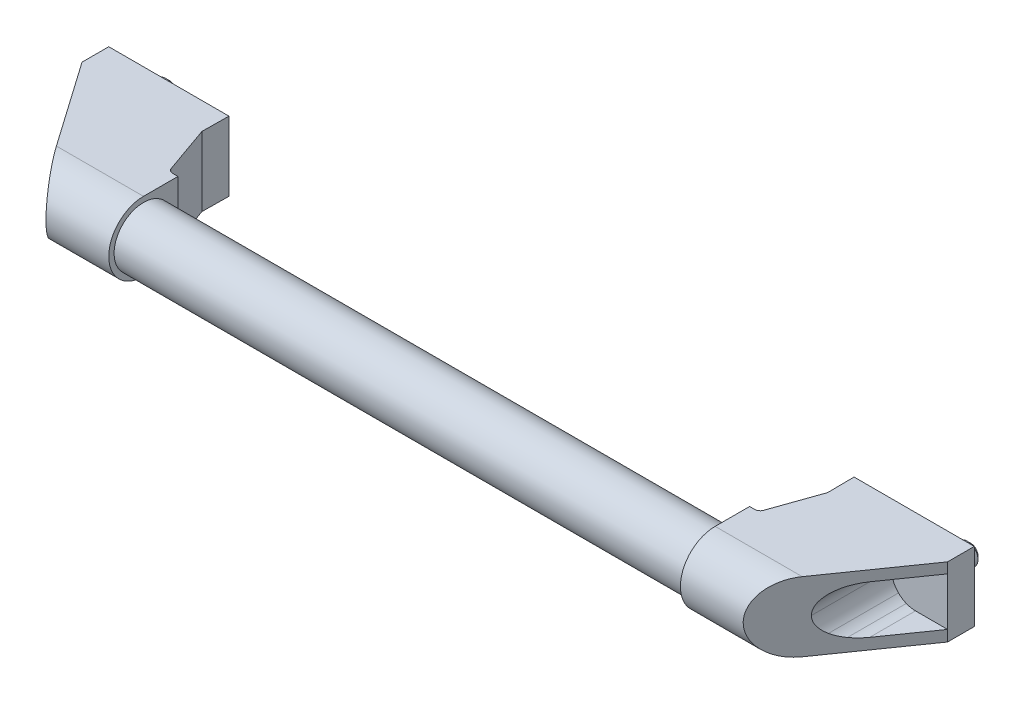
ISO-10303-21;
HEADER;
FILE_DESCRIPTION(('STEP AP214'),'2;1');
FILE_NAME('part.step','',(''),(''),'','','');
FILE_SCHEMA(('AUTOMOTIVE_DESIGN { 1 0 10303 214 1 1 1 1 }'));
ENDSEC;
DATA;
#1=APPLICATION_CONTEXT('core data for automotive mechanical design processes');
#2=APPLICATION_PROTOCOL_DEFINITION('international standard','automotive_design',2000,#1);
#3=PRODUCT_CONTEXT('',#1,'mechanical');
#4=PRODUCT('Part','Part','',(#3));
#5=PRODUCT_RELATED_PRODUCT_CATEGORY('part','',(#4));
#6=PRODUCT_DEFINITION_FORMATION('','',#4);
#7=PRODUCT_DEFINITION_CONTEXT('part definition',#1,'design');
#8=PRODUCT_DEFINITION('design','',#6,#7);
#9=PRODUCT_DEFINITION_SHAPE('','',#8);
#10=(LENGTH_UNIT() NAMED_UNIT(*) SI_UNIT(.MILLI.,.METRE.));
#11=(NAMED_UNIT(*) PLANE_ANGLE_UNIT() SI_UNIT($,.RADIAN.));
#12=(NAMED_UNIT(*) SI_UNIT($,.STERADIAN.) SOLID_ANGLE_UNIT());
#13=UNCERTAINTY_MEASURE_WITH_UNIT(LENGTH_MEASURE(1.E-05),#10,'distance_accuracy_value','');
#14=(GEOMETRIC_REPRESENTATION_CONTEXT(3) GLOBAL_UNCERTAINTY_ASSIGNED_CONTEXT((#13)) GLOBAL_UNIT_ASSIGNED_CONTEXT((#10,
#11,#12)) REPRESENTATION_CONTEXT('',''));
#15=CARTESIAN_POINT('',(0.,0.,0.));
#16=DIRECTION('',(0.,0.,1.));
#17=DIRECTION('',(1.,0.,0.));
#18=AXIS2_PLACEMENT_3D('',#15,#16,#17);
#19=CARTESIAN_POINT('',(312.,13.,-1.29670579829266E-13));
#20=DIRECTION('',(0.,0.,-1.));
#21=DIRECTION('',(-1.,0.,0.));
#22=AXIS2_PLACEMENT_3D('',#19,#20,#21);
#23=PLANE('',#22);
#24=DIRECTION('',(0.,-1.,0.));
#25=VECTOR('',#24,1.);
#26=CARTESIAN_POINT('',(287.,8.,-1.28803218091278E-13));
#27=LINE('',#26,#25);
#28=CARTESIAN_POINT('',(287.,8.,-1.28803218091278E-13));
#29=VERTEX_POINT('',#28);
#30=CARTESIAN_POINT('',(287.,-8.,-1.28803218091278E-13));
#31=VERTEX_POINT('',#30);
#32=EDGE_CURVE('E497',#29,#31,#27,.T.);
#33=ORIENTED_EDGE('',*,*,#32,.F.);
#34=DIRECTION('',(-1.,0.,0.));
#35=VECTOR('',#34,1.);
#36=CARTESIAN_POINT('',(287.,8.,-1.28803218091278E-13));
#37=LINE('',#36,#35);
#38=CARTESIAN_POINT('',(272.,8.,-1.08853898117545E-13));
#39=VERTEX_POINT('',#38);
#40=EDGE_CURVE('E30',#29,#39,#37,.T.);
#41=ORIENTED_EDGE('',*,*,#40,.T.);
#42=DIRECTION('',(0.,1.,0.));
#43=VECTOR('',#42,1.);
#44=CARTESIAN_POINT('',(272.,-8.,-1.08853898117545E-13));
#45=LINE('',#44,#43);
#46=CARTESIAN_POINT('',(272.,-8.,-1.08853898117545E-13));
#47=VERTEX_POINT('',#46);
#48=EDGE_CURVE('E491',#47,#39,#45,.T.);
#49=ORIENTED_EDGE('',*,*,#48,.F.);
#50=DIRECTION('',(1.,0.,0.));
#51=VECTOR('',#50,1.);
#52=CARTESIAN_POINT('',(272.,-8.,-1.08853898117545E-13));
#53=LINE('',#52,#51);
#54=EDGE_CURVE('E494',#47,#31,#53,.T.);
#55=ORIENTED_EDGE('',*,*,#54,.T.);
#56=EDGE_LOOP('',(#33,#41,#49,#55));
#57=FACE_BOUND('',#56,.T.);
#58=DIRECTION('',(0.,1.,0.));
#59=VECTOR('',#58,1.);
#60=CARTESIAN_POINT('',(267.,-13.,-1.16226472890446E-13));
#61=LINE('',#60,#59);
#62=CARTESIAN_POINT('',(267.,-13.,-1.16226472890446E-13));
#63=VERTEX_POINT('',#62);
#64=CARTESIAN_POINT('',(267.,13.,-1.16226472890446E-13));
#65=VERTEX_POINT('',#64);
#66=EDGE_CURVE('E595',#63,#65,#61,.T.);
#67=ORIENTED_EDGE('',*,*,#66,.T.);
#68=DIRECTION('',(-1.,0.,0.));
#69=VECTOR('',#68,1.);
#70=CARTESIAN_POINT('',(312.,13.,-1.29670579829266E-13));
#71=LINE('',#70,#69);
#72=CARTESIAN_POINT('',(312.,13.,-1.29670579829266E-13));
#73=VERTEX_POINT('',#72);
#74=EDGE_CURVE('E626',#73,#65,#71,.T.);
#75=ORIENTED_EDGE('',*,*,#74,.F.);
#76=DIRECTION('',(0.,-1.,0.));
#77=VECTOR('',#76,1.);
#78=CARTESIAN_POINT('',(312.,13.,-1.29670579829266E-13));
#79=LINE('',#78,#77);
#80=CARTESIAN_POINT('',(312.,-13.,-1.29670579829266E-13));
#81=VERTEX_POINT('',#80);
#82=EDGE_CURVE('E621',#73,#81,#79,.T.);
#83=ORIENTED_EDGE('',*,*,#82,.T.);
#84=DIRECTION('',(-1.,0.,0.));
#85=VECTOR('',#84,1.);
#86=CARTESIAN_POINT('',(312.,-13.,-1.29670579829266E-13));
#87=LINE('',#86,#85);
#88=EDGE_CURVE('E629',#81,#63,#87,.T.);
#89=ORIENTED_EDGE('',*,*,#88,.T.);
#90=EDGE_LOOP('',(#67,#75,#83,#89));
#91=FACE_BOUND('',#90,.T.);
#92=CARTESIAN_POINT('',(300.,0.,-1.25767452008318E-13));
#93=DIRECTION('',(0.,0.,1.));
#94=DIRECTION('',(1.,0.,0.));
#95=AXIS2_PLACEMENT_3D('',#92,#93,#94);
#96=CIRCLE('',#95,4.);
#97=CARTESIAN_POINT('',(304.,0.,-1.27287069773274E-13));
#98=VERTEX_POINT('',#97);
#99=EDGE_CURVE('E481',#98,#98,#96,.T.);
#100=ORIENTED_EDGE('',*,*,#99,.T.);
#101=EDGE_LOOP('',(#100));
#102=FACE_BOUND('',#101,.T.);
#103=ADVANCED_FACE('F14',(#57,#91,#102),#23,.T.);
#104=CARTESIAN_POINT('',(312.,-13.,9.99999999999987));
#105=DIRECTION('',(-0.819152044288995,0.,-0.573576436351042));
#106=DIRECTION('',(-0.573576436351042,0.,0.819152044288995));
#107=AXIS2_PLACEMENT_3D('',#104,#105,#106);
#108=PLANE('',#107);
#109=DIRECTION('',(0.573576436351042,0.,-0.819152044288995));
#110=VECTOR('',#109,1.);
#111=CARTESIAN_POINT('',(312.,-8.90119415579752,9.99999999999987));
#112=LINE('',#111,#110);
#113=CARTESIAN_POINT('',(299.999992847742,-8.90119415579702,27.1377862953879));
#114=VERTEX_POINT('',#113);
#115=CARTESIAN_POINT('',(312.,-8.90119415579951,9.99999999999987));
#116=VERTEX_POINT('',#115);
#117=EDGE_CURVE('E9',#114,#116,#112,.T.);
#118=ORIENTED_EDGE('',*,*,#117,.F.);
#119=CARTESIAN_POINT('',(299.999999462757,0.0988421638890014,27.1377768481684));
#120=DIRECTION('',(-0.819152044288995,0.,-0.573576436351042));
#121=DIRECTION('',(-0.573576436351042,0.,0.819152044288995));
#122=AXIS2_PLACEMENT_3D('',#119,#120,#121);
#123=ELLIPSE('',#122,15.6910844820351,9.00003631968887);
#124=CARTESIAN_POINT('',(296.555841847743,-8.21611015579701,32.0565436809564));
#125=VERTEX_POINT('',#124);
#126=EDGE_CURVE('E23',#114,#125,#123,.T.);
#127=ORIENTED_EDGE('',*,*,#126,.T.);
#128=CARTESIAN_POINT('',(300.000013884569,0.0988360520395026,27.1377562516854));
#129=DIRECTION('',(-0.819152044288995,0.,-0.573576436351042));
#130=DIRECTION('',(-0.573576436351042,0.,0.819152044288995));
#131=AXIS2_PLACEMENT_3D('',#128,#129,#130);
#132=ELLIPSE('',#131,15.6910842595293,9.00003619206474);
#133=CARTESIAN_POINT('',(293.636031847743,-6.26515515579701,36.2264645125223));
#134=VERTEX_POINT('',#133);
#135=EDGE_CURVE('E651',#125,#134,#132,.T.);
#136=ORIENTED_EDGE('',*,*,#135,.T.);
#137=CARTESIAN_POINT('',(300.000032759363,0.0988180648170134,27.1377292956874));
#138=DIRECTION('',(-0.819152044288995,0.,-0.573576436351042));
#139=DIRECTION('',(-0.573576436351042,0.,0.819152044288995));
#140=AXIS2_PLACEMENT_3D('',#137,#138,#139);
#141=ELLIPSE('',#140,15.6910853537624,9.00003681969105);
#142=CARTESIAN_POINT('',(290.999995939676,0.0988089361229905,39.9911139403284));
#143=VERTEX_POINT('',#142);
#144=EDGE_CURVE('E648',#134,#143,#141,.T.);
#145=ORIENTED_EDGE('',*,*,#144,.T.);
#146=CARTESIAN_POINT('',(300.000030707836,0.098790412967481,27.1377322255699));
#147=DIRECTION('',(-0.819152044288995,0.,-0.573576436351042));
#148=DIRECTION('',(-0.573576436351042,0.,0.819152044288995));
#149=AXIS2_PLACEMENT_3D('',#146,#147,#148);
#150=ELLIPSE('',#149,15.6910817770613,9.00003476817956);
#151=CARTESIAN_POINT('',(293.636039,6.4627699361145,36.2264542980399));
#152=VERTEX_POINT('',#151);
#153=EDGE_CURVE('E645',#143,#152,#150,.T.);
#154=ORIENTED_EDGE('',*,*,#153,.T.);
#155=CARTESIAN_POINT('',(300.000021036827,0.0987787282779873,27.1377460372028));
#156=DIRECTION('',(-0.819152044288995,0.,-0.573576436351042));
#157=DIRECTION('',(-0.573576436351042,0.,0.819152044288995));
#158=AXIS2_PLACEMENT_3D('',#155,#156,#157);
#159=ELLIPSE('',#158,15.6910842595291,9.00003619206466);
#160=CARTESIAN_POINT('',(296.555849,8.4137249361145,32.0565334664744));
#161=VERTEX_POINT('',#160);
#162=EDGE_CURVE('E642',#152,#161,#159,.T.);
#163=ORIENTED_EDGE('',*,*,#162,.T.);
#164=CARTESIAN_POINT('',(300.000006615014,0.098772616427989,27.1377666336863));
#165=DIRECTION('',(-0.819152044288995,0.,-0.573576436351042));
#166=DIRECTION('',(-0.573576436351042,0.,0.819152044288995));
#167=AXIS2_PLACEMENT_3D('',#164,#165,#166);
#168=ELLIPSE('',#167,15.691084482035,9.0000363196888);
#169=CARTESIAN_POINT('',(300.,9.09880893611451,27.1377760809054));
#170=VERTEX_POINT('',#169);
#171=EDGE_CURVE('E639',#161,#170,#168,.T.);
#172=ORIENTED_EDGE('',*,*,#171,.T.);
#173=DIRECTION('',(0.573576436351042,0.,-0.819152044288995));
#174=VECTOR('',#173,1.);
#175=CARTESIAN_POINT('',(312.,9.09880893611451,9.99999999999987));
#176=LINE('',#175,#174);
#177=CARTESIAN_POINT('',(312.,9.09880893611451,9.99999999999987));
#178=VERTEX_POINT('',#177);
#179=EDGE_CURVE('E636',#170,#178,#176,.T.);
#180=ORIENTED_EDGE('',*,*,#179,.T.);
#181=DIRECTION('',(0.,1.,0.));
#182=VECTOR('',#181,1.);
#183=CARTESIAN_POINT('',(312.,-13.,9.99999999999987));
#184=LINE('',#183,#182);
#185=CARTESIAN_POINT('',(312.,13.,9.99999999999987));
#186=VERTEX_POINT('',#185);
#187=EDGE_CURVE('E604',#178,#186,#184,.T.);
#188=ORIENTED_EDGE('',*,*,#187,.T.);
#189=DIRECTION('',(-0.573576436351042,0.,0.819152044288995));
#190=VECTOR('',#189,1.);
#191=CARTESIAN_POINT('',(312.,13.,9.99999999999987));
#192=LINE('',#191,#190);
#193=CARTESIAN_POINT('',(289.59335877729,13.,42.));
#194=VERTEX_POINT('',#193);
#195=EDGE_CURVE('E598',#186,#194,#192,.T.);
#196=ORIENTED_EDGE('',*,*,#195,.T.);
#197=CARTESIAN_POINT('',(289.59335877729,0.,42.));
#198=DIRECTION('',(-0.819152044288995,0.,-0.573576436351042));
#199=DIRECTION('',(-0.573576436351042,0.,0.819152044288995));
#200=AXIS2_PLACEMENT_3D('',#197,#198,#199);
#201=ELLIPSE('',#200,15.8700696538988,13.);
#202=CARTESIAN_POINT('',(289.59335877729,-13.,42.));
#203=VERTEX_POINT('',#202);
#204=EDGE_CURVE('E608',#203,#194,#201,.T.);
#205=ORIENTED_EDGE('',*,*,#204,.F.);
#206=DIRECTION('',(-0.573576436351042,0.,0.819152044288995));
#207=VECTOR('',#206,1.);
#208=CARTESIAN_POINT('',(312.,-13.,9.99999999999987));
#209=LINE('',#208,#207);
#210=CARTESIAN_POINT('',(312.,-13.,9.99999999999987));
#211=VERTEX_POINT('',#210);
#212=EDGE_CURVE('E601',#211,#203,#209,.T.);
#213=ORIENTED_EDGE('',*,*,#212,.F.);
#214=EDGE_CURVE('E605',#211,#116,#184,.T.);
#215=ORIENTED_EDGE('',*,*,#214,.T.);
#216=EDGE_LOOP('',(#118,#127,#136,#145,#154,#163,#172,#180,#188,#196,#205,#213,#215));
#217=FACE_BOUND('',#216,.T.);
#218=ADVANCED_FACE('F657',(#217),#108,.F.);
#219=CARTESIAN_POINT('',(312.,13.,42.));
#220=DIRECTION('',(0.,1.,0.));
#221=DIRECTION('',(-1.,0.,0.));
#222=AXIS2_PLACEMENT_3D('',#219,#220,#221);
#223=PLANE('',#222);
#224=DIRECTION('',(-0.0104830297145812,0.,-0.999945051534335));
#225=VECTOR('',#224,1.);
#226=CARTESIAN_POINT('',(267.104830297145,13.,9.99945051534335));
#227=LINE('',#226,#225);
#228=CARTESIAN_POINT('',(267.104830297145,13.,9.99945051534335));
#229=VERTEX_POINT('',#228);
#230=EDGE_CURVE('E573',#229,#65,#227,.T.);
#231=ORIENTED_EDGE('',*,*,#230,.F.);
#232=DIRECTION('',(-0.332150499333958,0.,0.943226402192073));
#233=VECTOR('',#232,1.);
#234=CARTESIAN_POINT('',(267.104830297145,13.,9.99945051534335));
#235=LINE('',#234,#233);
#236=CARTESIAN_POINT('',(260.854102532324,13.,27.7499927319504));
#237=VERTEX_POINT('',#236);
#238=EDGE_CURVE('E570',#229,#237,#235,.T.);
#239=ORIENTED_EDGE('',*,*,#238,.T.);
#240=CARTESIAN_POINT('',(258.967649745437,13.,27.0856916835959));
#241=DIRECTION('',(0.,1.,0.));
#242=DIRECTION('',(-1.,0.,0.));
#243=AXIS2_PLACEMENT_3D('',#240,#241,#242);
#244=CIRCLE('',#243,2.);
#245=CARTESIAN_POINT('',(258.988615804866,13.,29.0855817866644));
#246=VERTEX_POINT('',#245);
#247=EDGE_CURVE('E567',#246,#237,#244,.T.);
#248=ORIENTED_EDGE('',*,*,#247,.F.);
#249=DIRECTION('',(0.999945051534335,0.,-0.0104830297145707));
#250=VECTOR('',#249,1.);
#251=CARTESIAN_POINT('',(257.,13.,29.1064296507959));
#252=LINE('',#251,#250);
#253=CARTESIAN_POINT('',(257.,13.,29.1064296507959));
#254=VERTEX_POINT('',#253);
#255=EDGE_CURVE('E564',#254,#246,#252,.T.);
#256=ORIENTED_EDGE('',*,*,#255,.F.);
#257=DIRECTION('',(0.,0.,-1.));
#258=VECTOR('',#257,1.);
#259=CARTESIAN_POINT('',(257.,13.,42.));
#260=LINE('',#259,#258);
#261=CARTESIAN_POINT('',(257.,13.,42.));
#262=VERTEX_POINT('',#261);
#263=EDGE_CURVE('E610',#262,#254,#260,.T.);
#264=ORIENTED_EDGE('',*,*,#263,.F.);
#265=DIRECTION('',(-1.,0.,0.));
#266=VECTOR('',#265,1.);
#267=CARTESIAN_POINT('',(312.,13.,42.));
#268=LINE('',#267,#266);
#269=EDGE_CURVE('E634',#194,#262,#268,.T.);
#270=ORIENTED_EDGE('',*,*,#269,.F.);
#271=ORIENTED_EDGE('',*,*,#195,.F.);
#272=DIRECTION('',(0.,0.,-1.));
#273=VECTOR('',#272,1.);
#274=CARTESIAN_POINT('',(312.,13.,42.));
#275=LINE('',#274,#273);
#276=EDGE_CURVE('E619',#186,#73,#275,.T.);
#277=ORIENTED_EDGE('',*,*,#276,.T.);
#278=ORIENTED_EDGE('',*,*,#74,.T.);
#279=EDGE_LOOP('',(#231,#239,#248,#256,#264,#270,#271,#277,#278));
#280=FACE_BOUND('',#279,.T.);
#281=ADVANCED_FACE('F691',(#280),#223,.T.);
#282=CARTESIAN_POINT('',(312.,0.,42.));
#283=DIRECTION('',(-1.,0.,0.));
#284=DIRECTION('',(0.,-1.,0.));
#285=AXIS2_PLACEMENT_3D('',#282,#283,#284);
#286=CYLINDRICAL_SURFACE('',#285,13.);
#287=ORIENTED_EDGE('',*,*,#204,.T.);
#288=ORIENTED_EDGE('',*,*,#269,.T.);
#289=CARTESIAN_POINT('',(257.,0.,42.));
#290=DIRECTION('',(1.,0.,0.));
#291=DIRECTION('',(0.,1.,0.));
#292=AXIS2_PLACEMENT_3D('',#289,#290,#291);
#293=CIRCLE('',#292,13.);
#294=CARTESIAN_POINT('',(257.,-13.,42.));
#295=VERTEX_POINT('',#294);
#296=EDGE_CURVE('E616',#262,#295,#293,.T.);
#297=ORIENTED_EDGE('',*,*,#296,.T.);
#298=DIRECTION('',(-1.,0.,0.));
#299=VECTOR('',#298,1.);
#300=CARTESIAN_POINT('',(312.,-13.,42.));
#301=LINE('',#300,#299);
#302=EDGE_CURVE('E632',#203,#295,#301,.T.);
#303=ORIENTED_EDGE('',*,*,#302,.F.);
#304=EDGE_LOOP('',(#287,#288,#297,#303));
#305=FACE_BOUND('',#304,.T.);
#306=ADVANCED_FACE('F16',(#305),#286,.T.);
#307=CARTESIAN_POINT('',(312.,-13.,42.));
#308=DIRECTION('',(0.,1.,0.));
#309=DIRECTION('',(-1.,0.,0.));
#310=AXIS2_PLACEMENT_3D('',#307,#308,#309);
#311=PLANE('',#310);
#312=DIRECTION('',(-0.332150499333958,0.,0.943226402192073));
#313=VECTOR('',#312,1.);
#314=CARTESIAN_POINT('',(267.104830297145,-13.,9.99945051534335));
#315=LINE('',#314,#313);
#316=CARTESIAN_POINT('',(267.104830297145,-13.,9.99945051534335));
#317=VERTEX_POINT('',#316);
#318=CARTESIAN_POINT('',(260.854102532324,-13.,27.7499927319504));
#319=VERTEX_POINT('',#318);
#320=EDGE_CURVE('E581',#317,#319,#315,.T.);
#321=ORIENTED_EDGE('',*,*,#320,.F.);
#322=DIRECTION('',(-0.0104830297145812,0.,-0.999945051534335));
#323=VECTOR('',#322,1.);
#324=CARTESIAN_POINT('',(267.104830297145,-13.,9.99945051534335));
#325=LINE('',#324,#323);
#326=EDGE_CURVE('E584',#317,#63,#325,.T.);
#327=ORIENTED_EDGE('',*,*,#326,.T.);
#328=ORIENTED_EDGE('',*,*,#88,.F.);
#329=DIRECTION('',(0.,0.,-1.));
#330=VECTOR('',#329,1.);
#331=CARTESIAN_POINT('',(312.,-13.,42.));
#332=LINE('',#331,#330);
#333=EDGE_CURVE('E624',#211,#81,#332,.T.);
#334=ORIENTED_EDGE('',*,*,#333,.F.);
#335=ORIENTED_EDGE('',*,*,#212,.T.);
#336=ORIENTED_EDGE('',*,*,#302,.T.);
#337=DIRECTION('',(0.,0.,-1.));
#338=VECTOR('',#337,1.);
#339=CARTESIAN_POINT('',(257.,-13.,42.));
#340=LINE('',#339,#338);
#341=CARTESIAN_POINT('',(257.,-13.,29.1064296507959));
#342=VERTEX_POINT('',#341);
#343=EDGE_CURVE('E613',#295,#342,#340,.T.);
#344=ORIENTED_EDGE('',*,*,#343,.T.);
#345=DIRECTION('',(0.999945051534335,0.,-0.0104830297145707));
#346=VECTOR('',#345,1.);
#347=CARTESIAN_POINT('',(257.,-13.,29.1064296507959));
#348=LINE('',#347,#346);
#349=CARTESIAN_POINT('',(258.988615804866,-13.,29.0855817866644));
#350=VERTEX_POINT('',#349);
#351=EDGE_CURVE('E575',#342,#350,#348,.T.);
#352=ORIENTED_EDGE('',*,*,#351,.T.);
#353=CARTESIAN_POINT('',(258.967649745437,-13.,27.0856916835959));
#354=DIRECTION('',(0.,1.,0.));
#355=DIRECTION('',(-1.,0.,0.));
#356=AXIS2_PLACEMENT_3D('',#353,#354,#355);
#357=CIRCLE('',#356,2.);
#358=EDGE_CURVE('E578',#350,#319,#357,.T.);
#359=ORIENTED_EDGE('',*,*,#358,.T.);
#360=EDGE_LOOP('',(#321,#327,#328,#334,#335,#336,#344,#352,#359));
#361=FACE_BOUND('',#360,.T.);
#362=ADVANCED_FACE('F701',(#361),#311,.F.);
#363=CARTESIAN_POINT('',(312.,0.,42.));
#364=DIRECTION('',(1.,0.,0.));
#365=DIRECTION('',(0.,1.,0.));
#366=AXIS2_PLACEMENT_3D('',#363,#364,#365);
#367=PLANE('',#366);
#368=ORIENTED_EDGE('',*,*,#214,.F.);
#369=ORIENTED_EDGE('',*,*,#333,.T.);
#370=ORIENTED_EDGE('',*,*,#82,.F.);
#371=ORIENTED_EDGE('',*,*,#276,.F.);
#372=ORIENTED_EDGE('',*,*,#187,.F.);
#373=DIRECTION('',(0.,1.,0.));
#374=VECTOR('',#373,1.);
#375=CARTESIAN_POINT('',(312.,-8.90119415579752,9.99999999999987));
#376=LINE('',#375,#374);
#377=EDGE_CURVE('E541',#116,#178,#376,.T.);
#378=ORIENTED_EDGE('',*,*,#377,.F.);
#379=EDGE_LOOP('',(#368,#369,#370,#371,#372,#378));
#380=FACE_BOUND('',#379,.T.);
#381=ADVANCED_FACE('F686',(#380),#367,.T.);
#382=CARTESIAN_POINT('',(257.,0.,42.));
#383=DIRECTION('',(1.,0.,0.));
#384=DIRECTION('',(0.,1.,0.));
#385=AXIS2_PLACEMENT_3D('',#382,#383,#384);
#386=PLANE('',#385);
#387=CARTESIAN_POINT('',(257.,0.,42.));
#388=DIRECTION('',(1.,0.,0.));
#389=DIRECTION('',(0.,1.,0.));
#390=AXIS2_PLACEMENT_3D('',#387,#388,#389);
#391=CIRCLE('',#390,11.);
#392=CARTESIAN_POINT('',(257.,11.,42.));
#393=VERTEX_POINT('',#392);
#394=EDGE_CURVE('E18',#393,#393,#391,.T.);
#395=ORIENTED_EDGE('',*,*,#394,.T.);
#396=EDGE_LOOP('',(#395));
#397=FACE_BOUND('',#396,.T.);
#398=ORIENTED_EDGE('',*,*,#263,.T.);
#399=DIRECTION('',(0.,1.,0.));
#400=VECTOR('',#399,1.);
#401=CARTESIAN_POINT('',(257.,-13.,29.1064296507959));
#402=LINE('',#401,#400);
#403=EDGE_CURVE('E587',#342,#254,#402,.T.);
#404=ORIENTED_EDGE('',*,*,#403,.F.);
#405=ORIENTED_EDGE('',*,*,#343,.F.);
#406=ORIENTED_EDGE('',*,*,#296,.F.);
#407=EDGE_LOOP('',(#398,#404,#405,#406));
#408=FACE_BOUND('',#407,.T.);
#409=ADVANCED_FACE('F717',(#397,#408),#386,.F.);
#410=CARTESIAN_POINT('',(267.104830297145,-13.,9.99945051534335));
#411=DIRECTION('',(0.999945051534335,0.,-0.0104830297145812));
#412=DIRECTION('',(-0.0104830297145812,0.,-0.999945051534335));
#413=AXIS2_PLACEMENT_3D('',#410,#411,#412);
#414=PLANE('',#413);
#415=DIRECTION('',(0.,1.,0.));
#416=VECTOR('',#415,1.);
#417=CARTESIAN_POINT('',(267.104830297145,-13.,9.99945051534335));
#418=LINE('',#417,#416);
#419=EDGE_CURVE('E593',#317,#229,#418,.T.);
#420=ORIENTED_EDGE('',*,*,#419,.T.);
#421=ORIENTED_EDGE('',*,*,#230,.T.);
#422=ORIENTED_EDGE('',*,*,#66,.F.);
#423=ORIENTED_EDGE('',*,*,#326,.F.);
#424=EDGE_LOOP('',(#420,#421,#422,#423));
#425=FACE_BOUND('',#424,.T.);
#426=ADVANCED_FACE('F698',(#425),#414,.F.);
#427=CARTESIAN_POINT('',(267.104830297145,-13.,9.99945051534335));
#428=DIRECTION('',(-0.943226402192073,0.,-0.332150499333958));
#429=DIRECTION('',(-0.332150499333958,0.,0.943226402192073));
#430=AXIS2_PLACEMENT_3D('',#427,#428,#429);
#431=PLANE('',#430);
#432=DIRECTION('',(0.,1.,0.));
#433=VECTOR('',#432,1.);
#434=CARTESIAN_POINT('',(260.854102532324,-13.,27.7499927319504));
#435=LINE('',#434,#433);
#436=EDGE_CURVE('E591',#319,#237,#435,.T.);
#437=ORIENTED_EDGE('',*,*,#436,.T.);
#438=ORIENTED_EDGE('',*,*,#238,.F.);
#439=ORIENTED_EDGE('',*,*,#419,.F.);
#440=ORIENTED_EDGE('',*,*,#320,.T.);
#441=EDGE_LOOP('',(#437,#438,#439,#440));
#442=FACE_BOUND('',#441,.T.);
#443=ADVANCED_FACE('F705',(#442),#431,.T.);
#444=CARTESIAN_POINT('',(258.967649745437,-13.,27.0856916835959));
#445=DIRECTION('',(0.,1.,0.));
#446=DIRECTION('',(-1.,0.,0.));
#447=AXIS2_PLACEMENT_3D('',#444,#445,#446);
#448=CYLINDRICAL_SURFACE('',#447,2.);
#449=DIRECTION('',(0.,1.,0.));
#450=VECTOR('',#449,1.);
#451=CARTESIAN_POINT('',(258.988615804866,-13.,29.0855817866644));
#452=LINE('',#451,#450);
#453=EDGE_CURVE('E589',#350,#246,#452,.T.);
#454=ORIENTED_EDGE('',*,*,#453,.T.);
#455=ORIENTED_EDGE('',*,*,#247,.T.);
#456=ORIENTED_EDGE('',*,*,#436,.F.);
#457=ORIENTED_EDGE('',*,*,#358,.F.);
#458=EDGE_LOOP('',(#454,#455,#456,#457));
#459=FACE_BOUND('',#458,.T.);
#460=ADVANCED_FACE('F711',(#459),#448,.F.);
#461=CARTESIAN_POINT('',(257.,-13.,29.1064296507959));
#462=DIRECTION('',(0.0104830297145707,0.,0.999945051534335));
#463=DIRECTION('',(0.999945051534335,0.,-0.0104830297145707));
#464=AXIS2_PLACEMENT_3D('',#461,#462,#463);
#465=PLANE('',#464);
#466=ORIENTED_EDGE('',*,*,#403,.T.);
#467=ORIENTED_EDGE('',*,*,#255,.T.);
#468=ORIENTED_EDGE('',*,*,#453,.F.);
#469=ORIENTED_EDGE('',*,*,#351,.F.);
#470=EDGE_LOOP('',(#466,#467,#468,#469));
#471=FACE_BOUND('',#470,.T.);
#472=ADVANCED_FACE('F713',(#471),#465,.F.);
#473=CARTESIAN_POINT('',(312.,-8.90119415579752,9.99999999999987));
#474=DIRECTION('',(0.,1.,0.));
#475=DIRECTION('',(-1.,0.,0.));
#476=AXIS2_PLACEMENT_3D('',#473,#474,#475);
#477=PLANE('',#476);
#478=ORIENTED_EDGE('',*,*,#117,.T.);
#479=DIRECTION('',(-1.,0.,0.));
#480=VECTOR('',#479,1.);
#481=CARTESIAN_POINT('',(312.,-8.90119415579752,9.99999999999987));
#482=LINE('',#481,#480);
#483=CARTESIAN_POINT('',(299.999992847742,-8.90119415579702,9.99999999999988));
#484=VERTEX_POINT('',#483);
#485=EDGE_CURVE('E38',#116,#484,#482,.T.);
#486=ORIENTED_EDGE('',*,*,#485,.T.);
#487=DIRECTION('',(0.,0.,1.));
#488=VECTOR('',#487,1.);
#489=CARTESIAN_POINT('',(299.999992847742,-8.90119415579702,9.99999999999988));
#490=LINE('',#489,#488);
#491=EDGE_CURVE('E561',#484,#114,#490,.T.);
#492=ORIENTED_EDGE('',*,*,#491,.T.);
#493=EDGE_LOOP('',(#478,#486,#492));
#494=FACE_BOUND('',#493,.T.);
#495=ADVANCED_FACE('F662',(#494),#477,.T.);
#496=CARTESIAN_POINT('',(299.999999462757,0.0988421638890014,9.99999999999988));
#497=DIRECTION('',(0.,0.,1.));
#498=DIRECTION('',(1.,0.,0.));
#499=AXIS2_PLACEMENT_3D('',#496,#497,#498);
#500=CYLINDRICAL_SURFACE('',#499,9.00003631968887);
#501=ORIENTED_EDGE('',*,*,#491,.F.);
#502=CARTESIAN_POINT('',(299.999999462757,0.0988421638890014,9.99999999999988));
#503=DIRECTION('',(0.,0.,1.));
#504=DIRECTION('',(1.,0.,0.));
#505=AXIS2_PLACEMENT_3D('',#502,#503,#504);
#506=CIRCLE('',#505,9.00003631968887);
#507=CARTESIAN_POINT('',(296.555841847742,-8.21611015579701,9.99999999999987));
#508=VERTEX_POINT('',#507);
#509=EDGE_CURVE('E521',#508,#484,#506,.T.);
#510=ORIENTED_EDGE('',*,*,#509,.F.);
#511=DIRECTION('',(0.,0.,1.));
#512=VECTOR('',#511,1.);
#513=CARTESIAN_POINT('',(296.555841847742,-8.21611015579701,9.99999999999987));
#514=LINE('',#513,#512);
#515=EDGE_CURVE('E558',#508,#125,#514,.T.);
#516=ORIENTED_EDGE('',*,*,#515,.T.);
#517=ORIENTED_EDGE('',*,*,#126,.F.);
#518=EDGE_LOOP('',(#501,#510,#516,#517));
#519=FACE_BOUND('',#518,.T.);
#520=ADVANCED_FACE('F659',(#519),#500,.F.);
#521=CARTESIAN_POINT('',(300.000013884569,0.0988360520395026,9.99999999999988));
#522=DIRECTION('',(0.,0.,1.));
#523=DIRECTION('',(1.,0.,0.));
#524=AXIS2_PLACEMENT_3D('',#521,#522,#523);
#525=CYLINDRICAL_SURFACE('',#524,9.00003619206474);
#526=ORIENTED_EDGE('',*,*,#515,.F.);
#527=CARTESIAN_POINT('',(300.000013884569,0.0988360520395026,9.99999999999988));
#528=DIRECTION('',(0.,0.,1.));
#529=DIRECTION('',(1.,0.,0.));
#530=AXIS2_PLACEMENT_3D('',#527,#528,#529);
#531=CIRCLE('',#530,9.00003619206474);
#532=CARTESIAN_POINT('',(293.636031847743,-6.26515515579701,9.99999999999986));
#533=VERTEX_POINT('',#532);
#534=EDGE_CURVE('E523',#533,#508,#531,.T.);
#535=ORIENTED_EDGE('',*,*,#534,.F.);
#536=DIRECTION('',(0.,0.,1.));
#537=VECTOR('',#536,1.);
#538=CARTESIAN_POINT('',(293.636031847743,-6.26515515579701,9.99999999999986));
#539=LINE('',#538,#537);
#540=EDGE_CURVE('E555',#533,#134,#539,.T.);
#541=ORIENTED_EDGE('',*,*,#540,.T.);
#542=ORIENTED_EDGE('',*,*,#135,.F.);
#543=EDGE_LOOP('',(#526,#535,#541,#542));
#544=FACE_BOUND('',#543,.T.);
#545=ADVANCED_FACE('F667',(#544),#525,.F.);
#546=CARTESIAN_POINT('',(300.000032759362,0.0988180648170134,9.99999999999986));
#547=DIRECTION('',(0.,0.,1.));
#548=DIRECTION('',(1.,0.,0.));
#549=AXIS2_PLACEMENT_3D('',#546,#547,#548);
#550=CYLINDRICAL_SURFACE('',#549,9.00003681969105);
#551=ORIENTED_EDGE('',*,*,#540,.F.);
#552=CARTESIAN_POINT('',(300.000032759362,0.0988180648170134,9.99999999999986));
#553=DIRECTION('',(0.,0.,1.));
#554=DIRECTION('',(1.,0.,0.));
#555=AXIS2_PLACEMENT_3D('',#552,#553,#554);
#556=CIRCLE('',#555,9.00003681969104);
#557=CARTESIAN_POINT('',(290.999995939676,0.0988089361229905,9.99999999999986));
#558=VERTEX_POINT('',#557);
#559=EDGE_CURVE('E526',#558,#533,#556,.T.);
#560=ORIENTED_EDGE('',*,*,#559,.F.);
#561=DIRECTION('',(0.,0.,1.));
#562=VECTOR('',#561,1.);
#563=CARTESIAN_POINT('',(290.999995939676,0.0988089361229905,9.99999999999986));
#564=LINE('',#563,#562);
#565=EDGE_CURVE('E552',#558,#143,#564,.T.);
#566=ORIENTED_EDGE('',*,*,#565,.T.);
#567=ORIENTED_EDGE('',*,*,#144,.F.);
#568=EDGE_LOOP('',(#551,#560,#566,#567));
#569=FACE_BOUND('',#568,.T.);
#570=ADVANCED_FACE('F669',(#569),#550,.F.);
#571=CARTESIAN_POINT('',(300.000030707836,0.098790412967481,9.99999999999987));
#572=DIRECTION('',(0.,0.,1.));
#573=DIRECTION('',(1.,0.,0.));
#574=AXIS2_PLACEMENT_3D('',#571,#572,#573);
#575=CYLINDRICAL_SURFACE('',#574,9.00003476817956);
#576=ORIENTED_EDGE('',*,*,#565,.F.);
#577=CARTESIAN_POINT('',(300.000030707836,0.098790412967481,9.99999999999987));
#578=DIRECTION('',(0.,0.,1.));
#579=DIRECTION('',(1.,0.,0.));
#580=AXIS2_PLACEMENT_3D('',#577,#578,#579);
#581=CIRCLE('',#580,9.00003476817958);
#582=CARTESIAN_POINT('',(293.636039,6.4627699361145,9.99999999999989));
#583=VERTEX_POINT('',#582);
#584=EDGE_CURVE('E529',#583,#558,#581,.T.);
#585=ORIENTED_EDGE('',*,*,#584,.F.);
#586=DIRECTION('',(0.,0.,1.));
#587=VECTOR('',#586,1.);
#588=CARTESIAN_POINT('',(293.636039,6.4627699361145,9.99999999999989));
#589=LINE('',#588,#587);
#590=EDGE_CURVE('E549',#583,#152,#589,.T.);
#591=ORIENTED_EDGE('',*,*,#590,.T.);
#592=ORIENTED_EDGE('',*,*,#153,.F.);
#593=EDGE_LOOP('',(#576,#585,#591,#592));
#594=FACE_BOUND('',#593,.T.);
#595=ADVANCED_FACE('F672',(#594),#575,.F.);
#596=CARTESIAN_POINT('',(300.000021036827,0.0987787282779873,9.99999999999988));
#597=DIRECTION('',(0.,0.,1.));
#598=DIRECTION('',(1.,0.,0.));
#599=AXIS2_PLACEMENT_3D('',#596,#597,#598);
#600=CYLINDRICAL_SURFACE('',#599,9.00003619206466);
#601=ORIENTED_EDGE('',*,*,#590,.F.);
#602=CARTESIAN_POINT('',(300.000021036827,0.0987787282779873,9.99999999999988));
#603=DIRECTION('',(0.,0.,1.));
#604=DIRECTION('',(1.,0.,0.));
#605=AXIS2_PLACEMENT_3D('',#602,#603,#604);
#606=CIRCLE('',#605,9.00003619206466);
#607=CARTESIAN_POINT('',(296.555849,8.4137249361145,9.99999999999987));
#608=VERTEX_POINT('',#607);
#609=EDGE_CURVE('E532',#608,#583,#606,.T.);
#610=ORIENTED_EDGE('',*,*,#609,.F.);
#611=DIRECTION('',(0.,0.,1.));
#612=VECTOR('',#611,1.);
#613=CARTESIAN_POINT('',(296.555849,8.4137249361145,9.99999999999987));
#614=LINE('',#613,#612);
#615=EDGE_CURVE('E546',#608,#161,#614,.T.);
#616=ORIENTED_EDGE('',*,*,#615,.T.);
#617=ORIENTED_EDGE('',*,*,#162,.F.);
#618=EDGE_LOOP('',(#601,#610,#616,#617));
#619=FACE_BOUND('',#618,.T.);
#620=ADVANCED_FACE('F676',(#619),#600,.F.);
#621=CARTESIAN_POINT('',(300.000006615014,0.098772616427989,9.99999999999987));
#622=DIRECTION('',(0.,0.,1.));
#623=DIRECTION('',(1.,0.,0.));
#624=AXIS2_PLACEMENT_3D('',#621,#622,#623);
#625=CYLINDRICAL_SURFACE('',#624,9.0000363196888);
#626=ORIENTED_EDGE('',*,*,#615,.F.);
#627=CARTESIAN_POINT('',(300.000006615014,0.098772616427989,9.99999999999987));
#628=DIRECTION('',(0.,0.,1.));
#629=DIRECTION('',(1.,0.,0.));
#630=AXIS2_PLACEMENT_3D('',#627,#628,#629);
#631=CIRCLE('',#630,9.0000363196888);
#632=CARTESIAN_POINT('',(300.,9.09880893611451,9.99999999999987));
#633=VERTEX_POINT('',#632);
#634=EDGE_CURVE('E535',#633,#608,#631,.T.);
#635=ORIENTED_EDGE('',*,*,#634,.F.);
#636=DIRECTION('',(0.,0.,1.));
#637=VECTOR('',#636,1.);
#638=CARTESIAN_POINT('',(300.,9.09880893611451,9.99999999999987));
#639=LINE('',#638,#637);
#640=EDGE_CURVE('E543',#633,#170,#639,.T.);
#641=ORIENTED_EDGE('',*,*,#640,.T.);
#642=ORIENTED_EDGE('',*,*,#171,.F.);
#643=EDGE_LOOP('',(#626,#635,#641,#642));
#644=FACE_BOUND('',#643,.T.);
#645=ADVANCED_FACE('F679',(#644),#625,.F.);
#646=CARTESIAN_POINT('',(312.,9.09880893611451,9.99999999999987));
#647=DIRECTION('',(0.,1.,0.));
#648=DIRECTION('',(-1.,0.,0.));
#649=AXIS2_PLACEMENT_3D('',#646,#647,#648);
#650=PLANE('',#649);
#651=ORIENTED_EDGE('',*,*,#640,.F.);
#652=DIRECTION('',(-1.,0.,0.));
#653=VECTOR('',#652,1.);
#654=CARTESIAN_POINT('',(312.,9.09880893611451,9.99999999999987));
#655=LINE('',#654,#653);
#656=EDGE_CURVE('E538',#178,#633,#655,.T.);
#657=ORIENTED_EDGE('',*,*,#656,.F.);
#658=ORIENTED_EDGE('',*,*,#179,.F.);
#659=EDGE_LOOP('',(#651,#657,#658));
#660=FACE_BOUND('',#659,.T.);
#661=ADVANCED_FACE('F764',(#660),#650,.F.);
#662=CARTESIAN_POINT('',(299.999999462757,0.0988421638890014,9.99999999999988));
#663=DIRECTION('',(0.,0.,1.));
#664=DIRECTION('',(1.,0.,0.));
#665=AXIS2_PLACEMENT_3D('',#662,#663,#664);
#666=PLANE('',#665);
#667=ORIENTED_EDGE('',*,*,#485,.F.);
#668=ORIENTED_EDGE('',*,*,#377,.T.);
#669=ORIENTED_EDGE('',*,*,#656,.T.);
#670=ORIENTED_EDGE('',*,*,#634,.T.);
#671=ORIENTED_EDGE('',*,*,#609,.T.);
#672=ORIENTED_EDGE('',*,*,#584,.T.);
#673=ORIENTED_EDGE('',*,*,#559,.T.);
#674=ORIENTED_EDGE('',*,*,#534,.T.);
#675=ORIENTED_EDGE('',*,*,#509,.T.);
#676=EDGE_LOOP('',(#667,#668,#669,#670,#671,#672,#673,#674,#675));
#677=FACE_BOUND('',#676,.T.);
#678=ADVANCED_FACE('F664',(#677),#666,.T.);
#679=CARTESIAN_POINT('',(287.,8.,30.));
#680=DIRECTION('',(0.,-1.,0.));
#681=DIRECTION('',(1.,0.,0.));
#682=AXIS2_PLACEMENT_3D('',#679,#680,#681);
#683=PLANE('',#682);
#684=DIRECTION('',(0.,0.,-1.));
#685=VECTOR('',#684,1.);
#686=CARTESIAN_POINT('',(272.,8.,30.));
#687=LINE('',#686,#685);
#688=CARTESIAN_POINT('',(272.,8.,30.));
#689=VERTEX_POINT('',#688);
#690=EDGE_CURVE('E518',#689,#39,#687,.T.);
#691=ORIENTED_EDGE('',*,*,#690,.T.);
#692=ORIENTED_EDGE('',*,*,#40,.F.);
#693=DIRECTION('',(0.,0.,-1.));
#694=VECTOR('',#693,1.);
#695=CARTESIAN_POINT('',(287.,8.,30.));
#696=LINE('',#695,#694);
#697=CARTESIAN_POINT('',(287.,8.,30.));
#698=VERTEX_POINT('',#697);
#699=EDGE_CURVE('E512',#698,#29,#696,.T.);
#700=ORIENTED_EDGE('',*,*,#699,.F.);
#701=DIRECTION('',(-1.,0.,0.));
#702=VECTOR('',#701,1.);
#703=CARTESIAN_POINT('',(287.,8.,30.));
#704=LINE('',#703,#702);
#705=EDGE_CURVE('E500',#698,#689,#704,.T.);
#706=ORIENTED_EDGE('',*,*,#705,.T.);
#707=EDGE_LOOP('',(#691,#692,#700,#706));
#708=FACE_BOUND('',#707,.T.);
#709=ADVANCED_FACE('F771',(#708),#683,.T.);
#710=CARTESIAN_POINT('',(272.,-8.,30.));
#711=DIRECTION('',(-1.,0.,0.));
#712=DIRECTION('',(0.,-1.,0.));
#713=AXIS2_PLACEMENT_3D('',#710,#711,#712);
#714=PLANE('',#713);
#715=DIRECTION('',(0.,0.,-1.));
#716=VECTOR('',#715,1.);
#717=CARTESIAN_POINT('',(272.,-8.,30.));
#718=LINE('',#717,#716);
#719=CARTESIAN_POINT('',(272.,-8.,30.));
#720=VERTEX_POINT('',#719);
#721=EDGE_CURVE('E516',#720,#47,#718,.T.);
#722=ORIENTED_EDGE('',*,*,#721,.T.);
#723=ORIENTED_EDGE('',*,*,#48,.T.);
#724=ORIENTED_EDGE('',*,*,#690,.F.);
#725=DIRECTION('',(0.,1.,0.));
#726=VECTOR('',#725,1.);
#727=CARTESIAN_POINT('',(272.,-8.,30.));
#728=LINE('',#727,#726);
#729=EDGE_CURVE('E503',#720,#689,#728,.T.);
#730=ORIENTED_EDGE('',*,*,#729,.F.);
#731=EDGE_LOOP('',(#722,#723,#724,#730));
#732=FACE_BOUND('',#731,.T.);
#733=ADVANCED_FACE('F772',(#732),#714,.F.);
#734=CARTESIAN_POINT('',(272.,-8.,30.));
#735=DIRECTION('',(0.,1.,0.));
#736=DIRECTION('',(-1.,0.,0.));
#737=AXIS2_PLACEMENT_3D('',#734,#735,#736);
#738=PLANE('',#737);
#739=DIRECTION('',(0.,0.,-1.));
#740=VECTOR('',#739,1.);
#741=CARTESIAN_POINT('',(287.,-8.,30.));
#742=LINE('',#741,#740);
#743=CARTESIAN_POINT('',(287.,-8.,30.));
#744=VERTEX_POINT('',#743);
#745=EDGE_CURVE('E514',#744,#31,#742,.T.);
#746=ORIENTED_EDGE('',*,*,#745,.T.);
#747=ORIENTED_EDGE('',*,*,#54,.F.);
#748=ORIENTED_EDGE('',*,*,#721,.F.);
#749=DIRECTION('',(1.,0.,0.));
#750=VECTOR('',#749,1.);
#751=CARTESIAN_POINT('',(272.,-8.,30.));
#752=LINE('',#751,#750);
#753=EDGE_CURVE('E506',#720,#744,#752,.T.);
#754=ORIENTED_EDGE('',*,*,#753,.T.);
#755=EDGE_LOOP('',(#746,#747,#748,#754));
#756=FACE_BOUND('',#755,.T.);
#757=ADVANCED_FACE('F775',(#756),#738,.T.);
#758=CARTESIAN_POINT('',(287.,8.,30.));
#759=DIRECTION('',(1.,0.,0.));
#760=DIRECTION('',(0.,1.,0.));
#761=AXIS2_PLACEMENT_3D('',#758,#759,#760);
#762=PLANE('',#761);
#763=DIRECTION('',(0.,-1.,0.));
#764=VECTOR('',#763,1.);
#765=CARTESIAN_POINT('',(287.,8.,30.));
#766=LINE('',#765,#764);
#767=EDGE_CURVE('E509',#698,#744,#766,.T.);
#768=ORIENTED_EDGE('',*,*,#767,.F.);
#769=ORIENTED_EDGE('',*,*,#699,.T.);
#770=ORIENTED_EDGE('',*,*,#32,.T.);
#771=ORIENTED_EDGE('',*,*,#745,.F.);
#772=EDGE_LOOP('',(#768,#769,#770,#771));
#773=FACE_BOUND('',#772,.T.);
#774=ADVANCED_FACE('F779',(#773),#762,.F.);
#775=CARTESIAN_POINT('',(272.,8.,30.));
#776=DIRECTION('',(0.,0.,-1.));
#777=DIRECTION('',(-1.,0.,0.));
#778=AXIS2_PLACEMENT_3D('',#775,#776,#777);
#779=PLANE('',#778);
#780=ORIENTED_EDGE('',*,*,#705,.F.);
#781=ORIENTED_EDGE('',*,*,#767,.T.);
#782=ORIENTED_EDGE('',*,*,#753,.F.);
#783=ORIENTED_EDGE('',*,*,#729,.T.);
#784=EDGE_LOOP('',(#780,#781,#782,#783));
#785=FACE_BOUND('',#784,.T.);
#786=ADVANCED_FACE('F781',(#785),#779,.T.);
#787=CARTESIAN_POINT('',(300.,0.,-10.6000000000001));
#788=DIRECTION('',(0.,0.,1.));
#789=DIRECTION('',(1.,0.,0.));
#790=AXIS2_PLACEMENT_3D('',#787,#788,#789);
#791=PLANE('',#790);
#792=CARTESIAN_POINT('',(300.,0.,-10.6000000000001));
#793=DIRECTION('',(0.,0.,1.));
#794=DIRECTION('',(1.,0.,0.));
#795=AXIS2_PLACEMENT_3D('',#792,#793,#794);
#796=CIRCLE('',#795,2.8);
#797=CARTESIAN_POINT('',(302.8,0.,-10.6000000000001));
#798=VERTEX_POINT('',#797);
#799=EDGE_CURVE('E487',#798,#798,#796,.T.);
#800=ORIENTED_EDGE('',*,*,#799,.F.);
#801=EDGE_LOOP('',(#800));
#802=FACE_BOUND('',#801,.T.);
#803=ADVANCED_FACE('F785',(#802),#791,.F.);
#804=CARTESIAN_POINT('',(300.,0.,-10.6000000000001));
#805=DIRECTION('',(0.,0.,1.));
#806=DIRECTION('',(1.,0.,0.));
#807=AXIS2_PLACEMENT_3D('',#804,#805,#806);
#808=CONICAL_SURFACE('',#807,2.8,0.785398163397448);
#809=CARTESIAN_POINT('',(300.,0.,-9.40000000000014));
#810=DIRECTION('',(0.,0.,1.));
#811=DIRECTION('',(1.,0.,0.));
#812=AXIS2_PLACEMENT_3D('',#809,#810,#811);
#813=CIRCLE('',#812,4.);
#814=CARTESIAN_POINT('',(304.,0.,-9.40000000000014));
#815=VERTEX_POINT('',#814);
#816=EDGE_CURVE('E484',#815,#815,#813,.T.);
#817=ORIENTED_EDGE('',*,*,#816,.F.);
#818=EDGE_LOOP('',(#817));
#819=FACE_BOUND('',#818,.T.);
#820=ORIENTED_EDGE('',*,*,#799,.T.);
#821=EDGE_LOOP('',(#820));
#822=FACE_BOUND('',#821,.T.);
#823=ADVANCED_FACE('F793',(#819,#822),#808,.T.);
#824=CARTESIAN_POINT('',(300.,0.,27.1377760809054));
#825=DIRECTION('',(0.,0.,1.));
#826=DIRECTION('',(1.,0.,0.));
#827=AXIS2_PLACEMENT_3D('',#824,#825,#826);
#828=CYLINDRICAL_SURFACE('',#827,4.);
#829=ORIENTED_EDGE('',*,*,#816,.T.);
#830=EDGE_LOOP('',(#829));
#831=FACE_BOUND('',#830,.T.);
#832=ORIENTED_EDGE('',*,*,#99,.F.);
#833=EDGE_LOOP('',(#832));
#834=FACE_BOUND('',#833,.T.);
#835=ADVANCED_FACE('F797',(#831,#834),#828,.T.);
#836=CARTESIAN_POINT('',(296.555841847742,0.,42.));
#837=DIRECTION('',(1.,0.,0.));
#838=DIRECTION('',(0.,0.,-1.));
#839=AXIS2_PLACEMENT_3D('',#836,#837,#838);
#840=CYLINDRICAL_SURFACE('',#839,11.);
#841=ORIENTED_EDGE('',*,*,#394,.F.);
#842=EDGE_LOOP('',(#841));
#843=FACE_BOUND('',#842,.T.);
#844=CARTESIAN_POINT('',(43.,0.,42.));
#845=DIRECTION('',(1.,0.,0.));
#846=DIRECTION('',(0.,1.,0.));
#847=AXIS2_PLACEMENT_3D('',#844,#845,#846);
#848=CIRCLE('',#847,11.);
#849=CARTESIAN_POINT('',(43.,11.,42.));
#850=VERTEX_POINT('',#849);
#851=EDGE_CURVE('E477',#850,#850,#848,.T.);
#852=ORIENTED_EDGE('',*,*,#851,.T.);
#853=EDGE_LOOP('',(#852));
#854=FACE_BOUND('',#853,.T.);
#855=ADVANCED_FACE('F801',(#843,#854),#840,.T.);
#856=CARTESIAN_POINT('',(-12.,13.,0.));
#857=DIRECTION('',(0.,0.,-1.));
#858=DIRECTION('',(1.,0.,0.));
#859=AXIS2_PLACEMENT_3D('',#856,#857,#858);
#860=PLANE('',#859);
#861=DIRECTION('',(0.,-1.,0.));
#862=VECTOR('',#861,1.);
#863=CARTESIAN_POINT('',(13.,8.,0.));
#864=LINE('',#863,#862);
#865=CARTESIAN_POINT('',(13.,8.,0.));
#866=VERTEX_POINT('',#865);
#867=CARTESIAN_POINT('',(13.,-8.,0.));
#868=VERTEX_POINT('',#867);
#869=EDGE_CURVE('E319',#866,#868,#864,.T.);
#870=ORIENTED_EDGE('',*,*,#869,.T.);
#871=DIRECTION('',(-1.,0.,0.));
#872=VECTOR('',#871,1.);
#873=CARTESIAN_POINT('',(28.,-8.,0.));
#874=LINE('',#873,#872);
#875=CARTESIAN_POINT('',(28.,-8.,0.));
#876=VERTEX_POINT('',#875);
#877=EDGE_CURVE('E306',#876,#868,#874,.T.);
#878=ORIENTED_EDGE('',*,*,#877,.F.);
#879=DIRECTION('',(0.,1.,0.));
#880=VECTOR('',#879,1.);
#881=CARTESIAN_POINT('',(28.,-8.,0.));
#882=LINE('',#881,#880);
#883=CARTESIAN_POINT('',(28.,8.,0.));
#884=VERTEX_POINT('',#883);
#885=EDGE_CURVE('E288',#876,#884,#882,.T.);
#886=ORIENTED_EDGE('',*,*,#885,.T.);
#887=DIRECTION('',(1.,0.,0.));
#888=VECTOR('',#887,1.);
#889=CARTESIAN_POINT('',(13.,8.,0.));
#890=LINE('',#889,#888);
#891=EDGE_CURVE('E303',#866,#884,#890,.T.);
#892=ORIENTED_EDGE('',*,*,#891,.F.);
#893=EDGE_LOOP('',(#870,#878,#886,#892));
#894=FACE_BOUND('',#893,.T.);
#895=DIRECTION('',(0.,1.,0.));
#896=VECTOR('',#895,1.);
#897=CARTESIAN_POINT('',(33.,-13.,0.));
#898=LINE('',#897,#896);
#899=CARTESIAN_POINT('',(33.,-13.,0.));
#900=VERTEX_POINT('',#899);
#901=CARTESIAN_POINT('',(33.,13.,0.));
#902=VERTEX_POINT('',#901);
#903=EDGE_CURVE('E412',#900,#902,#898,.T.);
#904=ORIENTED_EDGE('',*,*,#903,.F.);
#905=DIRECTION('',(1.,0.,0.));
#906=VECTOR('',#905,1.);
#907=CARTESIAN_POINT('',(-12.,-13.,0.));
#908=LINE('',#907,#906);
#909=CARTESIAN_POINT('',(-12.,-13.,0.));
#910=VERTEX_POINT('',#909);
#911=EDGE_CURVE('E446',#910,#900,#908,.T.);
#912=ORIENTED_EDGE('',*,*,#911,.F.);
#913=DIRECTION('',(0.,-1.,0.));
#914=VECTOR('',#913,1.);
#915=CARTESIAN_POINT('',(-12.,13.,0.));
#916=LINE('',#915,#914);
#917=CARTESIAN_POINT('',(-12.,13.,0.));
#918=VERTEX_POINT('',#917);
#919=EDGE_CURVE('E438',#918,#910,#916,.T.);
#920=ORIENTED_EDGE('',*,*,#919,.F.);
#921=DIRECTION('',(1.,0.,0.));
#922=VECTOR('',#921,1.);
#923=CARTESIAN_POINT('',(-12.,13.,0.));
#924=LINE('',#923,#922);
#925=EDGE_CURVE('E443',#918,#902,#924,.T.);
#926=ORIENTED_EDGE('',*,*,#925,.T.);
#927=EDGE_LOOP('',(#904,#912,#920,#926));
#928=FACE_BOUND('',#927,.T.);
#929=CARTESIAN_POINT('',(0.,0.,0.));
#930=DIRECTION('',(0.,0.,-1.));
#931=DIRECTION('',(-1.,0.,0.));
#932=AXIS2_PLACEMENT_3D('',#929,#930,#931);
#933=CIRCLE('',#932,4.);
#934=CARTESIAN_POINT('',(-4.,0.,0.));
#935=VERTEX_POINT('',#934);
#936=EDGE_CURVE('E480',#935,#935,#933,.T.);
#937=ORIENTED_EDGE('',*,*,#936,.F.);
#938=EDGE_LOOP('',(#937));
#939=FACE_BOUND('',#938,.T.);
#940=ADVANCED_FACE('F301',(#894,#928,#939),#860,.T.);
#941=CARTESIAN_POINT('',(-12.,-13.,10.));
#942=DIRECTION('',(0.819152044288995,0.,-0.573576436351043));
#943=DIRECTION('',(0.573576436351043,0.,0.819152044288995));
#944=AXIS2_PLACEMENT_3D('',#941,#942,#943);
#945=PLANE('',#944);
#946=DIRECTION('',(-0.573576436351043,0.,-0.819152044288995));
#947=VECTOR('',#946,1.);
#948=CARTESIAN_POINT('',(-12.,-8.90119415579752,10.));
#949=LINE('',#948,#947);
#950=CARTESIAN_POINT('',(7.15225748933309E-06,-8.90119415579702,27.137786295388));
#951=VERTEX_POINT('',#950);
#952=CARTESIAN_POINT('',(-12.,-8.90119415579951,10.));
#953=VERTEX_POINT('',#952);
#954=EDGE_CURVE('E474',#951,#953,#949,.T.);
#955=ORIENTED_EDGE('',*,*,#954,.T.);
#956=DIRECTION('',(0.,1.,0.));
#957=VECTOR('',#956,1.);
#958=CARTESIAN_POINT('',(-12.,-13.,10.));
#959=LINE('',#958,#957);
#960=CARTESIAN_POINT('',(-12.,-13.,10.));
#961=VERTEX_POINT('',#960);
#962=EDGE_CURVE('E422',#961,#953,#959,.T.);
#963=ORIENTED_EDGE('',*,*,#962,.F.);
#964=DIRECTION('',(0.573576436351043,0.,0.819152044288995));
#965=VECTOR('',#964,1.);
#966=CARTESIAN_POINT('',(-12.,-13.,10.));
#967=LINE('',#966,#965);
#968=CARTESIAN_POINT('',(10.4066412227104,-13.,42.));
#969=VERTEX_POINT('',#968);
#970=EDGE_CURVE('E418',#961,#969,#967,.T.);
#971=ORIENTED_EDGE('',*,*,#970,.T.);
#972=CARTESIAN_POINT('',(10.4066412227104,0.,42.));
#973=DIRECTION('',(-0.819152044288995,0.,0.573576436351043));
#974=DIRECTION('',(0.573576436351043,0.,0.819152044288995));
#975=AXIS2_PLACEMENT_3D('',#972,#973,#974);
#976=ELLIPSE('',#975,15.8700696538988,13.);
#977=CARTESIAN_POINT('',(10.4066412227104,13.,42.));
#978=VERTEX_POINT('',#977);
#979=EDGE_CURVE('E425',#969,#978,#976,.T.);
#980=ORIENTED_EDGE('',*,*,#979,.T.);
#981=DIRECTION('',(0.573576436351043,0.,0.819152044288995));
#982=VECTOR('',#981,1.);
#983=CARTESIAN_POINT('',(-12.,13.,10.));
#984=LINE('',#983,#982);
#985=CARTESIAN_POINT('',(-12.,13.,10.));
#986=VERTEX_POINT('',#985);
#987=EDGE_CURVE('E415',#986,#978,#984,.T.);
#988=ORIENTED_EDGE('',*,*,#987,.F.);
#989=CARTESIAN_POINT('',(-12.,9.09880893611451,10.));
#990=VERTEX_POINT('',#989);
#991=EDGE_CURVE('E421',#990,#986,#959,.T.);
#992=ORIENTED_EDGE('',*,*,#991,.F.);
#993=DIRECTION('',(-0.573576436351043,0.,-0.819152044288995));
#994=VECTOR('',#993,1.);
#995=CARTESIAN_POINT('',(-12.,9.09880893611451,10.));
#996=LINE('',#995,#994);
#997=CARTESIAN_POINT('',(0.,9.09880893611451,27.1377760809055));
#998=VERTEX_POINT('',#997);
#999=EDGE_CURVE('E453',#998,#990,#996,.T.);
#1000=ORIENTED_EDGE('',*,*,#999,.F.);
#1001=CARTESIAN_POINT('',(-6.61501402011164E-06,0.098772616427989,27.1377666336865));
#1002=DIRECTION('',(-0.819152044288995,0.,0.573576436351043));
#1003=DIRECTION('',(0.573576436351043,0.,0.819152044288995));
#1004=AXIS2_PLACEMENT_3D('',#1001,#1002,#1003);
#1005=ELLIPSE('',#1004,15.691084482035,9.0000363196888);
#1006=CARTESIAN_POINT('',(3.444151,8.4137249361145,32.0565334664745));
#1007=VERTEX_POINT('',#1006);
#1008=EDGE_CURVE('E456',#1007,#998,#1005,.T.);
#1009=ORIENTED_EDGE('',*,*,#1008,.F.);
#1010=CARTESIAN_POINT('',(-2.10368270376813E-05,0.0987787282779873,27.137746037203));
#1011=DIRECTION('',(-0.819152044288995,0.,0.573576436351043));
#1012=DIRECTION('',(0.573576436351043,0.,0.819152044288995));
#1013=AXIS2_PLACEMENT_3D('',#1010,#1011,#1012);
#1014=ELLIPSE('',#1013,15.6910842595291,9.00003619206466);
#1015=CARTESIAN_POINT('',(6.36396099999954,6.4627699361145,36.22645429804));
#1016=VERTEX_POINT('',#1015);
#1017=EDGE_CURVE('E459',#1016,#1007,#1014,.T.);
#1018=ORIENTED_EDGE('',*,*,#1017,.F.);
#1019=CARTESIAN_POINT('',(-3.07078365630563E-05,0.098790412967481,27.13773222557));
#1020=DIRECTION('',(-0.819152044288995,0.,0.573576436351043));
#1021=DIRECTION('',(0.573576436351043,0.,0.819152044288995));
#1022=AXIS2_PLACEMENT_3D('',#1019,#1020,#1021);
#1023=ELLIPSE('',#1022,15.6910817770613,9.00003476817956);
#1024=CARTESIAN_POINT('',(9.00000406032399,0.0988089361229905,39.9911139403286));
#1025=VERTEX_POINT('',#1024);
#1026=EDGE_CURVE('E462',#1025,#1016,#1023,.T.);
#1027=ORIENTED_EDGE('',*,*,#1026,.F.);
#1028=CARTESIAN_POINT('',(-3.27593625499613E-05,0.0988180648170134,27.1377292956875));
#1029=DIRECTION('',(-0.819152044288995,0.,0.573576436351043));
#1030=DIRECTION('',(0.573576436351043,0.,0.819152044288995));
#1031=AXIS2_PLACEMENT_3D('',#1028,#1029,#1030);
#1032=ELLIPSE('',#1031,15.6910853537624,9.00003681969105);
#1033=CARTESIAN_POINT('',(6.36396815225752,-6.26515515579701,36.2264645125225));
#1034=VERTEX_POINT('',#1033);
#1035=EDGE_CURVE('E465',#1034,#1025,#1032,.T.);
#1036=ORIENTED_EDGE('',*,*,#1035,.F.);
#1037=CARTESIAN_POINT('',(-1.38845694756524E-05,0.0988360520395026,27.1377562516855));
#1038=DIRECTION('',(-0.819152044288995,0.,0.573576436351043));
#1039=DIRECTION('',(0.573576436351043,0.,0.819152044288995));
#1040=AXIS2_PLACEMENT_3D('',#1037,#1038,#1039);
#1041=ELLIPSE('',#1040,15.6910842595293,9.00003619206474);
#1042=CARTESIAN_POINT('',(3.44415815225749,-8.21611015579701,32.0565436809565));
#1043=VERTEX_POINT('',#1042);
#1044=EDGE_CURVE('E468',#1043,#1034,#1041,.T.);
#1045=ORIENTED_EDGE('',*,*,#1044,.F.);
#1046=CARTESIAN_POINT('',(5.37242991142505E-07,0.0988421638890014,27.1377768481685));
#1047=DIRECTION('',(-0.819152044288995,0.,0.573576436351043));
#1048=DIRECTION('',(0.573576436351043,0.,0.819152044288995));
#1049=AXIS2_PLACEMENT_3D('',#1046,#1047,#1048);
#1050=ELLIPSE('',#1049,15.6910844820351,9.00003631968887);
#1051=EDGE_CURVE('E471',#951,#1043,#1050,.T.);
#1052=ORIENTED_EDGE('',*,*,#1051,.F.);
#1053=EDGE_LOOP('',(#955,#963,#971,#980,#988,#992,#1000,#1009,#1018,#1027,#1036,#1045,#1052));
#1054=FACE_BOUND('',#1053,.T.);
#1055=ADVANCED_FACE('F818',(#1054),#945,.F.);
#1056=CARTESIAN_POINT('',(-12.,13.,42.));
#1057=DIRECTION('',(0.,1.,0.));
#1058=DIRECTION('',(1.,0.,0.));
#1059=AXIS2_PLACEMENT_3D('',#1056,#1057,#1058);
#1060=PLANE('',#1059);
#1061=DIRECTION('',(0.0104830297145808,0.,-0.999945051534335));
#1062=VECTOR('',#1061,1.);
#1063=CARTESIAN_POINT('',(32.8951697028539,13.,9.99945051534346));
#1064=LINE('',#1063,#1062);
#1065=CARTESIAN_POINT('',(32.8951697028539,13.,9.99945051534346));
#1066=VERTEX_POINT('',#1065);
#1067=EDGE_CURVE('E390',#1066,#902,#1064,.T.);
#1068=ORIENTED_EDGE('',*,*,#1067,.T.);
#1069=ORIENTED_EDGE('',*,*,#925,.F.);
#1070=DIRECTION('',(0.,0.,-1.));
#1071=VECTOR('',#1070,1.);
#1072=CARTESIAN_POINT('',(-12.,13.,42.));
#1073=LINE('',#1072,#1071);
#1074=EDGE_CURVE('E436',#986,#918,#1073,.T.);
#1075=ORIENTED_EDGE('',*,*,#1074,.F.);
#1076=ORIENTED_EDGE('',*,*,#987,.T.);
#1077=DIRECTION('',(1.,0.,0.));
#1078=VECTOR('',#1077,1.);
#1079=CARTESIAN_POINT('',(-12.,13.,42.));
#1080=LINE('',#1079,#1078);
#1081=CARTESIAN_POINT('',(43.,13.,42.));
#1082=VERTEX_POINT('',#1081);
#1083=EDGE_CURVE('E451',#978,#1082,#1080,.T.);
#1084=ORIENTED_EDGE('',*,*,#1083,.T.);
#1085=DIRECTION('',(0.,0.,-1.));
#1086=VECTOR('',#1085,1.);
#1087=CARTESIAN_POINT('',(43.,13.,42.));
#1088=LINE('',#1087,#1086);
#1089=CARTESIAN_POINT('',(43.,13.,29.106429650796));
#1090=VERTEX_POINT('',#1089);
#1091=EDGE_CURVE('E427',#1082,#1090,#1088,.T.);
#1092=ORIENTED_EDGE('',*,*,#1091,.T.);
#1093=DIRECTION('',(-0.999945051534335,0.,-0.0104830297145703));
#1094=VECTOR('',#1093,1.);
#1095=CARTESIAN_POINT('',(43.,13.,29.106429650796));
#1096=LINE('',#1095,#1094);
#1097=CARTESIAN_POINT('',(41.0113841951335,13.,29.0855817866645));
#1098=VERTEX_POINT('',#1097);
#1099=EDGE_CURVE('E381',#1090,#1098,#1096,.T.);
#1100=ORIENTED_EDGE('',*,*,#1099,.T.);
#1101=CARTESIAN_POINT('',(41.0323502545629,13.,27.085691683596));
#1102=DIRECTION('',(0.,-1.,0.));
#1103=DIRECTION('',(1.,0.,0.));
#1104=AXIS2_PLACEMENT_3D('',#1101,#1102,#1103);
#1105=CIRCLE('',#1104,2.);
#1106=CARTESIAN_POINT('',(39.1458974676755,13.,27.7499927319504));
#1107=VERTEX_POINT('',#1106);
#1108=EDGE_CURVE('E384',#1098,#1107,#1105,.T.);
#1109=ORIENTED_EDGE('',*,*,#1108,.T.);
#1110=DIRECTION('',(0.332150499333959,0.,0.943226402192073));
#1111=VECTOR('',#1110,1.);
#1112=CARTESIAN_POINT('',(32.8951697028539,13.,9.99945051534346));
#1113=LINE('',#1112,#1111);
#1114=EDGE_CURVE('E387',#1066,#1107,#1113,.T.);
#1115=ORIENTED_EDGE('',*,*,#1114,.F.);
#1116=EDGE_LOOP('',(#1068,#1069,#1075,#1076,#1084,#1092,#1100,#1109,#1115));
#1117=FACE_BOUND('',#1116,.T.);
#1118=ADVANCED_FACE('F810',(#1117),#1060,.T.);
#1119=CARTESIAN_POINT('',(-12.,0.,42.));
#1120=DIRECTION('',(1.,0.,0.));
#1121=DIRECTION('',(0.,-1.,0.));
#1122=AXIS2_PLACEMENT_3D('',#1119,#1120,#1121);
#1123=CYLINDRICAL_SURFACE('',#1122,13.);
#1124=ORIENTED_EDGE('',*,*,#979,.F.);
#1125=DIRECTION('',(1.,0.,0.));
#1126=VECTOR('',#1125,1.);
#1127=CARTESIAN_POINT('',(-12.,-13.,42.));
#1128=LINE('',#1127,#1126);
#1129=CARTESIAN_POINT('',(43.,-13.,42.));
#1130=VERTEX_POINT('',#1129);
#1131=EDGE_CURVE('E449',#969,#1130,#1128,.T.);
#1132=ORIENTED_EDGE('',*,*,#1131,.T.);
#1133=CARTESIAN_POINT('',(43.,0.,42.));
#1134=DIRECTION('',(1.,0.,0.));
#1135=DIRECTION('',(0.,1.,0.));
#1136=AXIS2_PLACEMENT_3D('',#1133,#1134,#1135);
#1137=CIRCLE('',#1136,13.);
#1138=EDGE_CURVE('E433',#1082,#1130,#1137,.T.);
#1139=ORIENTED_EDGE('',*,*,#1138,.F.);
#1140=ORIENTED_EDGE('',*,*,#1083,.F.);
#1141=EDGE_LOOP('',(#1124,#1132,#1139,#1140));
#1142=FACE_BOUND('',#1141,.T.);
#1143=ADVANCED_FACE('F806',(#1142),#1123,.T.);
#1144=CARTESIAN_POINT('',(-12.,-13.,42.));
#1145=DIRECTION('',(0.,1.,0.));
#1146=DIRECTION('',(1.,0.,0.));
#1147=AXIS2_PLACEMENT_3D('',#1144,#1145,#1146);
#1148=PLANE('',#1147);
#1149=DIRECTION('',(0.332150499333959,0.,0.943226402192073));
#1150=VECTOR('',#1149,1.);
#1151=CARTESIAN_POINT('',(32.8951697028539,-13.,9.99945051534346));
#1152=LINE('',#1151,#1150);
#1153=CARTESIAN_POINT('',(32.8951697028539,-13.,9.99945051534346));
#1154=VERTEX_POINT('',#1153);
#1155=CARTESIAN_POINT('',(39.1458974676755,-13.,27.7499927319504));
#1156=VERTEX_POINT('',#1155);
#1157=EDGE_CURVE('E398',#1154,#1156,#1152,.T.);
#1158=ORIENTED_EDGE('',*,*,#1157,.T.);
#1159=CARTESIAN_POINT('',(41.0323502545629,-13.,27.085691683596));
#1160=DIRECTION('',(0.,-1.,0.));
#1161=DIRECTION('',(1.,0.,0.));
#1162=AXIS2_PLACEMENT_3D('',#1159,#1160,#1161);
#1163=CIRCLE('',#1162,2.);
#1164=CARTESIAN_POINT('',(41.0113841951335,-13.,29.0855817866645));
#1165=VERTEX_POINT('',#1164);
#1166=EDGE_CURVE('E395',#1165,#1156,#1163,.T.);
#1167=ORIENTED_EDGE('',*,*,#1166,.F.);
#1168=DIRECTION('',(-0.999945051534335,0.,-0.0104830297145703));
#1169=VECTOR('',#1168,1.);
#1170=CARTESIAN_POINT('',(43.,-13.,29.106429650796));
#1171=LINE('',#1170,#1169);
#1172=CARTESIAN_POINT('',(43.,-13.,29.106429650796));
#1173=VERTEX_POINT('',#1172);
#1174=EDGE_CURVE('E392',#1173,#1165,#1171,.T.);
#1175=ORIENTED_EDGE('',*,*,#1174,.F.);
#1176=DIRECTION('',(0.,0.,-1.));
#1177=VECTOR('',#1176,1.);
#1178=CARTESIAN_POINT('',(43.,-13.,42.));
#1179=LINE('',#1178,#1177);
#1180=EDGE_CURVE('E430',#1130,#1173,#1179,.T.);
#1181=ORIENTED_EDGE('',*,*,#1180,.F.);
#1182=ORIENTED_EDGE('',*,*,#1131,.F.);
#1183=ORIENTED_EDGE('',*,*,#970,.F.);
#1184=DIRECTION('',(0.,0.,-1.));
#1185=VECTOR('',#1184,1.);
#1186=CARTESIAN_POINT('',(-12.,-13.,42.));
#1187=LINE('',#1186,#1185);
#1188=EDGE_CURVE('E441',#961,#910,#1187,.T.);
#1189=ORIENTED_EDGE('',*,*,#1188,.T.);
#1190=ORIENTED_EDGE('',*,*,#911,.T.);
#1191=DIRECTION('',(0.0104830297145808,0.,-0.999945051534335));
#1192=VECTOR('',#1191,1.);
#1193=CARTESIAN_POINT('',(32.8951697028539,-13.,9.99945051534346));
#1194=LINE('',#1193,#1192);
#1195=EDGE_CURVE('E401',#1154,#900,#1194,.T.);
#1196=ORIENTED_EDGE('',*,*,#1195,.F.);
#1197=EDGE_LOOP('',(#1158,#1167,#1175,#1181,#1182,#1183,#1189,#1190,#1196));
#1198=FACE_BOUND('',#1197,.T.);
#1199=ADVANCED_FACE('F809',(#1198),#1148,.F.);
#1200=CARTESIAN_POINT('',(-12.,0.,42.));
#1201=DIRECTION('',(-1.,0.,0.));
#1202=DIRECTION('',(0.,1.,0.));
#1203=AXIS2_PLACEMENT_3D('',#1200,#1201,#1202);
#1204=PLANE('',#1203);
#1205=ORIENTED_EDGE('',*,*,#962,.T.);
#1206=DIRECTION('',(0.,1.,0.));
#1207=VECTOR('',#1206,1.);
#1208=CARTESIAN_POINT('',(-12.,-8.90119415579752,10.));
#1209=LINE('',#1208,#1207);
#1210=EDGE_CURVE('E357',#953,#990,#1209,.T.);
#1211=ORIENTED_EDGE('',*,*,#1210,.T.);
#1212=ORIENTED_EDGE('',*,*,#991,.T.);
#1213=ORIENTED_EDGE('',*,*,#1074,.T.);
#1214=ORIENTED_EDGE('',*,*,#919,.T.);
#1215=ORIENTED_EDGE('',*,*,#1188,.F.);
#1216=EDGE_LOOP('',(#1205,#1211,#1212,#1213,#1214,#1215));
#1217=FACE_BOUND('',#1216,.T.);
#1218=ADVANCED_FACE('F814',(#1217),#1204,.T.);
#1219=CARTESIAN_POINT('',(43.,0.,42.));
#1220=DIRECTION('',(-1.,0.,0.));
#1221=DIRECTION('',(0.,1.,0.));
#1222=AXIS2_PLACEMENT_3D('',#1219,#1220,#1221);
#1223=PLANE('',#1222);
#1224=ORIENTED_EDGE('',*,*,#851,.F.);
#1225=EDGE_LOOP('',(#1224));
#1226=FACE_BOUND('',#1225,.T.);
#1227=ORIENTED_EDGE('',*,*,#1091,.F.);
#1228=ORIENTED_EDGE('',*,*,#1138,.T.);
#1229=ORIENTED_EDGE('',*,*,#1180,.T.);
#1230=DIRECTION('',(0.,1.,0.));
#1231=VECTOR('',#1230,1.);
#1232=CARTESIAN_POINT('',(43.,-13.,29.106429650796));
#1233=LINE('',#1232,#1231);
#1234=EDGE_CURVE('E404',#1173,#1090,#1233,.T.);
#1235=ORIENTED_EDGE('',*,*,#1234,.T.);
#1236=EDGE_LOOP('',(#1227,#1228,#1229,#1235));
#1237=FACE_BOUND('',#1236,.T.);
#1238=ADVANCED_FACE('F824',(#1226,#1237),#1223,.F.);
#1239=CARTESIAN_POINT('',(32.8951697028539,-13.,9.99945051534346));
#1240=DIRECTION('',(-0.999945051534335,0.,-0.0104830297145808));
#1241=DIRECTION('',(0.0104830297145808,0.,-0.999945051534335));
#1242=AXIS2_PLACEMENT_3D('',#1239,#1240,#1241);
#1243=PLANE('',#1242);
#1244=DIRECTION('',(0.,1.,0.));
#1245=VECTOR('',#1244,1.);
#1246=CARTESIAN_POINT('',(32.8951697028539,-13.,9.99945051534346));
#1247=LINE('',#1246,#1245);
#1248=EDGE_CURVE('E410',#1154,#1066,#1247,.T.);
#1249=ORIENTED_EDGE('',*,*,#1248,.F.);
#1250=ORIENTED_EDGE('',*,*,#1195,.T.);
#1251=ORIENTED_EDGE('',*,*,#903,.T.);
#1252=ORIENTED_EDGE('',*,*,#1067,.F.);
#1253=EDGE_LOOP('',(#1249,#1250,#1251,#1252));
#1254=FACE_BOUND('',#1253,.T.);
#1255=ADVANCED_FACE('F828',(#1254),#1243,.F.);
#1256=CARTESIAN_POINT('',(32.8951697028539,-13.,9.99945051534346));
#1257=DIRECTION('',(0.943226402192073,0.,-0.332150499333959));
#1258=DIRECTION('',(0.332150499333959,0.,0.943226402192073));
#1259=AXIS2_PLACEMENT_3D('',#1256,#1257,#1258);
#1260=PLANE('',#1259);
#1261=DIRECTION('',(0.,1.,0.));
#1262=VECTOR('',#1261,1.);
#1263=CARTESIAN_POINT('',(39.1458974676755,-13.,27.7499927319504));
#1264=LINE('',#1263,#1262);
#1265=EDGE_CURVE('E408',#1156,#1107,#1264,.T.);
#1266=ORIENTED_EDGE('',*,*,#1265,.F.);
#1267=ORIENTED_EDGE('',*,*,#1157,.F.);
#1268=ORIENTED_EDGE('',*,*,#1248,.T.);
#1269=ORIENTED_EDGE('',*,*,#1114,.T.);
#1270=EDGE_LOOP('',(#1266,#1267,#1268,#1269));
#1271=FACE_BOUND('',#1270,.T.);
#1272=ADVANCED_FACE('F835',(#1271),#1260,.T.);
#1273=CARTESIAN_POINT('',(41.0323502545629,-13.,27.085691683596));
#1274=DIRECTION('',(0.,1.,0.));
#1275=DIRECTION('',(1.,0.,0.));
#1276=AXIS2_PLACEMENT_3D('',#1273,#1274,#1275);
#1277=CYLINDRICAL_SURFACE('',#1276,2.);
#1278=DIRECTION('',(0.,1.,0.));
#1279=VECTOR('',#1278,1.);
#1280=CARTESIAN_POINT('',(41.0113841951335,-13.,29.0855817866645));
#1281=LINE('',#1280,#1279);
#1282=EDGE_CURVE('E406',#1165,#1098,#1281,.T.);
#1283=ORIENTED_EDGE('',*,*,#1282,.F.);
#1284=ORIENTED_EDGE('',*,*,#1166,.T.);
#1285=ORIENTED_EDGE('',*,*,#1265,.T.);
#1286=ORIENTED_EDGE('',*,*,#1108,.F.);
#1287=EDGE_LOOP('',(#1283,#1284,#1285,#1286));
#1288=FACE_BOUND('',#1287,.T.);
#1289=ADVANCED_FACE('F839',(#1288),#1277,.F.);
#1290=CARTESIAN_POINT('',(43.,-13.,29.106429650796));
#1291=DIRECTION('',(-0.0104830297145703,0.,0.999945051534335));
#1292=DIRECTION('',(-0.999945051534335,0.,-0.0104830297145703));
#1293=AXIS2_PLACEMENT_3D('',#1290,#1291,#1292);
#1294=PLANE('',#1293);
#1295=ORIENTED_EDGE('',*,*,#1234,.F.);
#1296=ORIENTED_EDGE('',*,*,#1174,.T.);
#1297=ORIENTED_EDGE('',*,*,#1282,.T.);
#1298=ORIENTED_EDGE('',*,*,#1099,.F.);
#1299=EDGE_LOOP('',(#1295,#1296,#1297,#1298));
#1300=FACE_BOUND('',#1299,.T.);
#1301=ADVANCED_FACE('F843',(#1300),#1294,.F.);
#1302=CARTESIAN_POINT('',(-12.,-8.90119415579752,10.));
#1303=DIRECTION('',(0.,1.,0.));
#1304=DIRECTION('',(1.,0.,0.));
#1305=AXIS2_PLACEMENT_3D('',#1302,#1303,#1304);
#1306=PLANE('',#1305);
#1307=ORIENTED_EDGE('',*,*,#954,.F.);
#1308=DIRECTION('',(0.,0.,1.));
#1309=VECTOR('',#1308,1.);
#1310=CARTESIAN_POINT('',(7.15225747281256E-06,-8.90119415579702,10.));
#1311=LINE('',#1310,#1309);
#1312=CARTESIAN_POINT('',(7.15225747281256E-06,-8.90119415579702,10.));
#1313=VERTEX_POINT('',#1312);
#1314=EDGE_CURVE('E378',#1313,#951,#1311,.T.);
#1315=ORIENTED_EDGE('',*,*,#1314,.F.);
#1316=DIRECTION('',(1.,0.,0.));
#1317=VECTOR('',#1316,1.);
#1318=CARTESIAN_POINT('',(-12.,-8.90119415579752,10.));
#1319=LINE('',#1318,#1317);
#1320=EDGE_CURVE('E295',#953,#1313,#1319,.T.);
#1321=ORIENTED_EDGE('',*,*,#1320,.F.);
#1322=EDGE_LOOP('',(#1307,#1315,#1321));
#1323=FACE_BOUND('',#1322,.T.);
#1324=ADVANCED_FACE('F847',(#1323),#1306,.T.);
#1325=CARTESIAN_POINT('',(5.37242994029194E-07,0.0988421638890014,10.));
#1326=DIRECTION('',(0.,0.,1.));
#1327=DIRECTION('',(-1.,0.,0.));
#1328=AXIS2_PLACEMENT_3D('',#1325,#1326,#1327);
#1329=CYLINDRICAL_SURFACE('',#1328,9.00003631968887);
#1330=ORIENTED_EDGE('',*,*,#1314,.T.);
#1331=ORIENTED_EDGE('',*,*,#1051,.T.);
#1332=DIRECTION('',(0.,0.,1.));
#1333=VECTOR('',#1332,1.);
#1334=CARTESIAN_POINT('',(3.44415815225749,-8.21611015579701,10.));
#1335=LINE('',#1334,#1333);
#1336=CARTESIAN_POINT('',(3.44415815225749,-8.21611015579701,10.));
#1337=VERTEX_POINT('',#1336);
#1338=EDGE_CURVE('E375',#1337,#1043,#1335,.T.);
#1339=ORIENTED_EDGE('',*,*,#1338,.F.);
#1340=CARTESIAN_POINT('',(5.37242994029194E-07,0.0988421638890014,10.));
#1341=DIRECTION('',(0.,0.,-1.));
#1342=DIRECTION('',(-1.,0.,0.));
#1343=AXIS2_PLACEMENT_3D('',#1340,#1341,#1342);
#1344=CIRCLE('',#1343,9.00003631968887);
#1345=EDGE_CURVE('E336',#1337,#1313,#1344,.T.);
#1346=ORIENTED_EDGE('',*,*,#1345,.T.);
#1347=EDGE_LOOP('',(#1330,#1331,#1339,#1346));
#1348=FACE_BOUND('',#1347,.T.);
#1349=ADVANCED_FACE('F849',(#1348),#1329,.F.);
#1350=CARTESIAN_POINT('',(-1.38845695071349E-05,0.0988360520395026,10.));
#1351=DIRECTION('',(0.,0.,1.));
#1352=DIRECTION('',(-1.,0.,0.));
#1353=AXIS2_PLACEMENT_3D('',#1350,#1351,#1352);
#1354=CYLINDRICAL_SURFACE('',#1353,9.00003619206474);
#1355=ORIENTED_EDGE('',*,*,#1338,.T.);
#1356=ORIENTED_EDGE('',*,*,#1044,.T.);
#1357=DIRECTION('',(0.,0.,1.));
#1358=VECTOR('',#1357,1.);
#1359=CARTESIAN_POINT('',(6.36396815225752,-6.26515515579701,10.));
#1360=LINE('',#1359,#1358);
#1361=CARTESIAN_POINT('',(6.36396815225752,-6.26515515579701,10.));
#1362=VERTEX_POINT('',#1361);
#1363=EDGE_CURVE('E372',#1362,#1034,#1360,.T.);
#1364=ORIENTED_EDGE('',*,*,#1363,.F.);
#1365=CARTESIAN_POINT('',(-1.38845695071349E-05,0.0988360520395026,10.));
#1366=DIRECTION('',(0.,0.,-1.));
#1367=DIRECTION('',(-1.,0.,0.));
#1368=AXIS2_PLACEMENT_3D('',#1365,#1366,#1367);
#1369=CIRCLE('',#1368,9.00003619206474);
#1370=EDGE_CURVE('E339',#1362,#1337,#1369,.T.);
#1371=ORIENTED_EDGE('',*,*,#1370,.T.);
#1372=EDGE_LOOP('',(#1355,#1356,#1364,#1371));
#1373=FACE_BOUND('',#1372,.T.);
#1374=ADVANCED_FACE('F852',(#1373),#1354,.F.);
#1375=CARTESIAN_POINT('',(-3.27593625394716E-05,0.0988180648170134,10.));
#1376=DIRECTION('',(0.,0.,1.));
#1377=DIRECTION('',(-1.,0.,0.));
#1378=AXIS2_PLACEMENT_3D('',#1375,#1376,#1377);
#1379=CYLINDRICAL_SURFACE('',#1378,9.00003681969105);
#1380=ORIENTED_EDGE('',*,*,#1363,.T.);
#1381=ORIENTED_EDGE('',*,*,#1035,.T.);
#1382=DIRECTION('',(0.,0.,1.));
#1383=VECTOR('',#1382,1.);
#1384=CARTESIAN_POINT('',(9.00000406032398,0.0988089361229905,10.));
#1385=LINE('',#1384,#1383);
#1386=CARTESIAN_POINT('',(9.00000406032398,0.0988089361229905,10.));
#1387=VERTEX_POINT('',#1386);
#1388=EDGE_CURVE('E369',#1387,#1025,#1385,.T.);
#1389=ORIENTED_EDGE('',*,*,#1388,.F.);
#1390=CARTESIAN_POINT('',(-3.27593625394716E-05,0.0988180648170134,10.));
#1391=DIRECTION('',(0.,0.,-1.));
#1392=DIRECTION('',(-1.,0.,0.));
#1393=AXIS2_PLACEMENT_3D('',#1390,#1391,#1392);
#1394=CIRCLE('',#1393,9.00003681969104);
#1395=EDGE_CURVE('E342',#1387,#1362,#1394,.T.);
#1396=ORIENTED_EDGE('',*,*,#1395,.T.);
#1397=EDGE_LOOP('',(#1380,#1381,#1389,#1396));
#1398=FACE_BOUND('',#1397,.T.);
#1399=ADVANCED_FACE('F856',(#1398),#1379,.F.);
#1400=CARTESIAN_POINT('',(-3.07078365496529E-05,0.098790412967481,10.));
#1401=DIRECTION('',(0.,0.,1.));
#1402=DIRECTION('',(-1.,0.,0.));
#1403=AXIS2_PLACEMENT_3D('',#1400,#1401,#1402);
#1404=CYLINDRICAL_SURFACE('',#1403,9.00003476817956);
#1405=ORIENTED_EDGE('',*,*,#1388,.T.);
#1406=ORIENTED_EDGE('',*,*,#1026,.T.);
#1407=DIRECTION('',(0.,0.,1.));
#1408=VECTOR('',#1407,1.);
#1409=CARTESIAN_POINT('',(6.36396099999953,6.4627699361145,10.));
#1410=LINE('',#1409,#1408);
#1411=CARTESIAN_POINT('',(6.36396099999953,6.4627699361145,10.));
#1412=VERTEX_POINT('',#1411);
#1413=EDGE_CURVE('E366',#1412,#1016,#1410,.T.);
#1414=ORIENTED_EDGE('',*,*,#1413,.F.);
#1415=CARTESIAN_POINT('',(-3.07078365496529E-05,0.098790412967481,10.));
#1416=DIRECTION('',(0.,0.,-1.));
#1417=DIRECTION('',(-1.,0.,0.));
#1418=AXIS2_PLACEMENT_3D('',#1415,#1416,#1417);
#1419=CIRCLE('',#1418,9.00003476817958);
#1420=EDGE_CURVE('E345',#1412,#1387,#1419,.T.);
#1421=ORIENTED_EDGE('',*,*,#1420,.T.);
#1422=EDGE_LOOP('',(#1405,#1406,#1414,#1421));
#1423=FACE_BOUND('',#1422,.T.);
#1424=ADVANCED_FACE('F860',(#1423),#1404,.F.);
#1425=CARTESIAN_POINT('',(-2.1036827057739E-05,0.0987787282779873,10.));
#1426=DIRECTION('',(0.,0.,1.));
#1427=DIRECTION('',(-1.,0.,0.));
#1428=AXIS2_PLACEMENT_3D('',#1425,#1426,#1427);
#1429=CYLINDRICAL_SURFACE('',#1428,9.00003619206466);
#1430=ORIENTED_EDGE('',*,*,#1413,.T.);
#1431=ORIENTED_EDGE('',*,*,#1017,.T.);
#1432=DIRECTION('',(0.,0.,1.));
#1433=VECTOR('',#1432,1.);
#1434=CARTESIAN_POINT('',(3.444151,8.4137249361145,10.));
#1435=LINE('',#1434,#1433);
#1436=CARTESIAN_POINT('',(3.444151,8.4137249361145,10.));
#1437=VERTEX_POINT('',#1436);
#1438=EDGE_CURVE('E363',#1437,#1007,#1435,.T.);
#1439=ORIENTED_EDGE('',*,*,#1438,.F.);
#1440=CARTESIAN_POINT('',(-2.1036827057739E-05,0.0987787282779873,10.));
#1441=DIRECTION('',(0.,0.,-1.));
#1442=DIRECTION('',(-1.,0.,0.));
#1443=AXIS2_PLACEMENT_3D('',#1440,#1441,#1442);
#1444=CIRCLE('',#1443,9.00003619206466);
#1445=EDGE_CURVE('E348',#1437,#1412,#1444,.T.);
#1446=ORIENTED_EDGE('',*,*,#1445,.T.);
#1447=EDGE_LOOP('',(#1430,#1431,#1439,#1446));
#1448=FACE_BOUND('',#1447,.T.);
#1449=ADVANCED_FACE('F864',(#1448),#1429,.F.);
#1450=CARTESIAN_POINT('',(-6.61501400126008E-06,0.098772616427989,10.));
#1451=DIRECTION('',(0.,0.,1.));
#1452=DIRECTION('',(-1.,0.,0.));
#1453=AXIS2_PLACEMENT_3D('',#1450,#1451,#1452);
#1454=CYLINDRICAL_SURFACE('',#1453,9.0000363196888);
#1455=ORIENTED_EDGE('',*,*,#1438,.T.);
#1456=ORIENTED_EDGE('',*,*,#1008,.T.);
#1457=DIRECTION('',(0.,0.,1.));
#1458=VECTOR('',#1457,1.);
#1459=CARTESIAN_POINT('',(0.,9.09880893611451,10.));
#1460=LINE('',#1459,#1458);
#1461=CARTESIAN_POINT('',(0.,9.09880893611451,10.));
#1462=VERTEX_POINT('',#1461);
#1463=EDGE_CURVE('E360',#1462,#998,#1460,.T.);
#1464=ORIENTED_EDGE('',*,*,#1463,.F.);
#1465=CARTESIAN_POINT('',(-6.61501400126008E-06,0.098772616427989,10.));
#1466=DIRECTION('',(0.,0.,-1.));
#1467=DIRECTION('',(-1.,0.,0.));
#1468=AXIS2_PLACEMENT_3D('',#1465,#1466,#1467);
#1469=CIRCLE('',#1468,9.0000363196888);
#1470=EDGE_CURVE('E351',#1462,#1437,#1469,.T.);
#1471=ORIENTED_EDGE('',*,*,#1470,.T.);
#1472=EDGE_LOOP('',(#1455,#1456,#1464,#1471));
#1473=FACE_BOUND('',#1472,.T.);
#1474=ADVANCED_FACE('F868',(#1473),#1454,.F.);
#1475=CARTESIAN_POINT('',(-12.,9.09880893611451,10.));
#1476=DIRECTION('',(0.,1.,0.));
#1477=DIRECTION('',(1.,0.,0.));
#1478=AXIS2_PLACEMENT_3D('',#1475,#1476,#1477);
#1479=PLANE('',#1478);
#1480=ORIENTED_EDGE('',*,*,#1463,.T.);
#1481=ORIENTED_EDGE('',*,*,#999,.T.);
#1482=DIRECTION('',(1.,0.,0.));
#1483=VECTOR('',#1482,1.);
#1484=CARTESIAN_POINT('',(-12.,9.09880893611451,10.));
#1485=LINE('',#1484,#1483);
#1486=EDGE_CURVE('E354',#990,#1462,#1485,.T.);
#1487=ORIENTED_EDGE('',*,*,#1486,.T.);
#1488=EDGE_LOOP('',(#1480,#1481,#1487));
#1489=FACE_BOUND('',#1488,.T.);
#1490=ADVANCED_FACE('F872',(#1489),#1479,.F.);
#1491=CARTESIAN_POINT('',(5.37242994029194E-07,0.0988421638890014,10.));
#1492=DIRECTION('',(0.,0.,1.));
#1493=DIRECTION('',(-1.,0.,0.));
#1494=AXIS2_PLACEMENT_3D('',#1491,#1492,#1493);
#1495=PLANE('',#1494);
#1496=ORIENTED_EDGE('',*,*,#1320,.T.);
#1497=ORIENTED_EDGE('',*,*,#1345,.F.);
#1498=ORIENTED_EDGE('',*,*,#1370,.F.);
#1499=ORIENTED_EDGE('',*,*,#1395,.F.);
#1500=ORIENTED_EDGE('',*,*,#1420,.F.);
#1501=ORIENTED_EDGE('',*,*,#1445,.F.);
#1502=ORIENTED_EDGE('',*,*,#1470,.F.);
#1503=ORIENTED_EDGE('',*,*,#1486,.F.);
#1504=ORIENTED_EDGE('',*,*,#1210,.F.);
#1505=EDGE_LOOP('',(#1496,#1497,#1498,#1499,#1500,#1501,#1502,#1503,#1504));
#1506=FACE_BOUND('',#1505,.T.);
#1507=ADVANCED_FACE('F876',(#1506),#1495,.T.);
#1508=CARTESIAN_POINT('',(13.,8.,30.));
#1509=DIRECTION('',(0.,-1.,0.));
#1510=DIRECTION('',(-1.,0.,0.));
#1511=AXIS2_PLACEMENT_3D('',#1508,#1509,#1510);
#1512=PLANE('',#1511);
#1513=DIRECTION('',(0.,0.,-1.));
#1514=VECTOR('',#1513,1.);
#1515=CARTESIAN_POINT('',(28.,8.,30.));
#1516=LINE('',#1515,#1514);
#1517=CARTESIAN_POINT('',(28.,8.,30.));
#1518=VERTEX_POINT('',#1517);
#1519=EDGE_CURVE('E285',#1518,#884,#1516,.T.);
#1520=ORIENTED_EDGE('',*,*,#1519,.F.);
#1521=DIRECTION('',(1.,0.,0.));
#1522=VECTOR('',#1521,1.);
#1523=CARTESIAN_POINT('',(13.,8.,30.));
#1524=LINE('',#1523,#1522);
#1525=CARTESIAN_POINT('',(13.,8.,30.));
#1526=VERTEX_POINT('',#1525);
#1527=EDGE_CURVE('E321',#1526,#1518,#1524,.T.);
#1528=ORIENTED_EDGE('',*,*,#1527,.F.);
#1529=DIRECTION('',(0.,0.,-1.));
#1530=VECTOR('',#1529,1.);
#1531=CARTESIAN_POINT('',(13.,8.,30.));
#1532=LINE('',#1531,#1530);
#1533=EDGE_CURVE('E309',#1526,#866,#1532,.T.);
#1534=ORIENTED_EDGE('',*,*,#1533,.T.);
#1535=ORIENTED_EDGE('',*,*,#891,.T.);
#1536=EDGE_LOOP('',(#1520,#1528,#1534,#1535));
#1537=FACE_BOUND('',#1536,.T.);
#1538=ADVANCED_FACE('F308',(#1537),#1512,.T.);
#1539=CARTESIAN_POINT('',(28.,-8.,30.));
#1540=DIRECTION('',(1.,0.,0.));
#1541=DIRECTION('',(0.,-1.,0.));
#1542=AXIS2_PLACEMENT_3D('',#1539,#1540,#1541);
#1543=PLANE('',#1542);
#1544=DIRECTION('',(0.,0.,-1.));
#1545=VECTOR('',#1544,1.);
#1546=CARTESIAN_POINT('',(28.,-8.,30.));
#1547=LINE('',#1546,#1545);
#1548=CARTESIAN_POINT('',(28.,-8.,30.));
#1549=VERTEX_POINT('',#1548);
#1550=EDGE_CURVE('E296',#1549,#876,#1547,.T.);
#1551=ORIENTED_EDGE('',*,*,#1550,.F.);
#1552=DIRECTION('',(0.,1.,0.));
#1553=VECTOR('',#1552,1.);
#1554=CARTESIAN_POINT('',(28.,-8.,30.));
#1555=LINE('',#1554,#1553);
#1556=EDGE_CURVE('E290',#1549,#1518,#1555,.T.);
#1557=ORIENTED_EDGE('',*,*,#1556,.T.);
#1558=ORIENTED_EDGE('',*,*,#1519,.T.);
#1559=ORIENTED_EDGE('',*,*,#885,.F.);
#1560=EDGE_LOOP('',(#1551,#1557,#1558,#1559));
#1561=FACE_BOUND('',#1560,.T.);
#1562=ADVANCED_FACE('F287',(#1561),#1543,.F.);
#1563=CARTESIAN_POINT('',(28.,-8.,30.));
#1564=DIRECTION('',(0.,1.,0.));
#1565=DIRECTION('',(1.,0.,0.));
#1566=AXIS2_PLACEMENT_3D('',#1563,#1564,#1565);
#1567=PLANE('',#1566);
#1568=DIRECTION('',(0.,0.,-1.));
#1569=VECTOR('',#1568,1.);
#1570=CARTESIAN_POINT('',(13.,-8.,30.));
#1571=LINE('',#1570,#1569);
#1572=CARTESIAN_POINT('',(13.,-8.,30.));
#1573=VERTEX_POINT('',#1572);
#1574=EDGE_CURVE('E331',#1573,#868,#1571,.T.);
#1575=ORIENTED_EDGE('',*,*,#1574,.F.);
#1576=DIRECTION('',(-1.,0.,0.));
#1577=VECTOR('',#1576,1.);
#1578=CARTESIAN_POINT('',(28.,-8.,30.));
#1579=LINE('',#1578,#1577);
#1580=EDGE_CURVE('E324',#1549,#1573,#1579,.T.);
#1581=ORIENTED_EDGE('',*,*,#1580,.F.);
#1582=ORIENTED_EDGE('',*,*,#1550,.T.);
#1583=ORIENTED_EDGE('',*,*,#877,.T.);
#1584=EDGE_LOOP('',(#1575,#1581,#1582,#1583));
#1585=FACE_BOUND('',#1584,.T.);
#1586=ADVANCED_FACE('F886',(#1585),#1567,.T.);
#1587=CARTESIAN_POINT('',(13.,8.,30.));
#1588=DIRECTION('',(-1.,0.,0.));
#1589=DIRECTION('',(0.,1.,0.));
#1590=AXIS2_PLACEMENT_3D('',#1587,#1588,#1589);
#1591=PLANE('',#1590);
#1592=DIRECTION('',(0.,-1.,0.));
#1593=VECTOR('',#1592,1.);
#1594=CARTESIAN_POINT('',(13.,8.,30.));
#1595=LINE('',#1594,#1593);
#1596=EDGE_CURVE('E327',#1526,#1573,#1595,.T.);
#1597=ORIENTED_EDGE('',*,*,#1596,.T.);
#1598=ORIENTED_EDGE('',*,*,#1574,.T.);
#1599=ORIENTED_EDGE('',*,*,#869,.F.);
#1600=ORIENTED_EDGE('',*,*,#1533,.F.);
#1601=EDGE_LOOP('',(#1597,#1598,#1599,#1600));
#1602=FACE_BOUND('',#1601,.T.);
#1603=ADVANCED_FACE('F889',(#1602),#1591,.F.);
#1604=CARTESIAN_POINT('',(28.,8.,30.));
#1605=DIRECTION('',(0.,0.,-1.));
#1606=DIRECTION('',(1.,0.,0.));
#1607=AXIS2_PLACEMENT_3D('',#1604,#1605,#1606);
#1608=PLANE('',#1607);
#1609=ORIENTED_EDGE('',*,*,#1527,.T.);
#1610=ORIENTED_EDGE('',*,*,#1556,.F.);
#1611=ORIENTED_EDGE('',*,*,#1580,.T.);
#1612=ORIENTED_EDGE('',*,*,#1596,.F.);
#1613=EDGE_LOOP('',(#1609,#1610,#1611,#1612));
#1614=FACE_BOUND('',#1613,.T.);
#1615=ADVANCED_FACE('F891',(#1614),#1608,.T.);
#1616=CARTESIAN_POINT('',(0.,0.,-10.6));
#1617=DIRECTION('',(0.,0.,1.));
#1618=DIRECTION('',(-1.,0.,0.));
#1619=AXIS2_PLACEMENT_3D('',#1616,#1617,#1618);
#1620=PLANE('',#1619);
#1621=CARTESIAN_POINT('',(0.,0.,-10.6));
#1622=DIRECTION('',(0.,0.,-1.));
#1623=DIRECTION('',(-1.,0.,0.));
#1624=AXIS2_PLACEMENT_3D('',#1621,#1622,#1623);
#1625=CIRCLE('',#1624,2.8);
#1626=CARTESIAN_POINT('',(-2.80000000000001,0.,-10.6));
#1627=VERTEX_POINT('',#1626);
#1628=EDGE_CURVE('E311',#1627,#1627,#1625,.T.);
#1629=ORIENTED_EDGE('',*,*,#1628,.T.);
#1630=EDGE_LOOP('',(#1629));
#1631=FACE_BOUND('',#1630,.T.);
#1632=ADVANCED_FACE('F895',(#1631),#1620,.F.);
#1633=CARTESIAN_POINT('',(0.,0.,-10.6));
#1634=DIRECTION('',(0.,0.,1.));
#1635=DIRECTION('',(-1.,0.,0.));
#1636=AXIS2_PLACEMENT_3D('',#1633,#1634,#1635);
#1637=CONICAL_SURFACE('',#1636,2.8,0.785398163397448);
#1638=CARTESIAN_POINT('',(0.,0.,-9.4));
#1639=DIRECTION('',(0.,0.,-1.));
#1640=DIRECTION('',(-1.,0.,0.));
#1641=AXIS2_PLACEMENT_3D('',#1638,#1639,#1640);
#1642=CIRCLE('',#1641,4.);
#1643=CARTESIAN_POINT('',(-4.00000000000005,0.,-9.4));
#1644=VERTEX_POINT('',#1643);
#1645=EDGE_CURVE('E314',#1644,#1644,#1642,.T.);
#1646=ORIENTED_EDGE('',*,*,#1645,.T.);
#1647=EDGE_LOOP('',(#1646));
#1648=FACE_BOUND('',#1647,.T.);
#1649=ORIENTED_EDGE('',*,*,#1628,.F.);
#1650=EDGE_LOOP('',(#1649));
#1651=FACE_BOUND('',#1650,.T.);
#1652=ADVANCED_FACE('F903',(#1648,#1651),#1637,.T.);
#1653=CARTESIAN_POINT('',(0.,0.,27.1377760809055));
#1654=DIRECTION('',(0.,0.,1.));
#1655=DIRECTION('',(-1.,0.,0.));
#1656=AXIS2_PLACEMENT_3D('',#1653,#1654,#1655);
#1657=CYLINDRICAL_SURFACE('',#1656,4.);
#1658=ORIENTED_EDGE('',*,*,#1645,.F.);
#1659=EDGE_LOOP('',(#1658));
#1660=FACE_BOUND('',#1659,.T.);
#1661=ORIENTED_EDGE('',*,*,#936,.T.);
#1662=EDGE_LOOP('',(#1661));
#1663=FACE_BOUND('',#1662,.T.);
#1664=ADVANCED_FACE('F907',(#1660,#1663),#1657,.T.);
#1665=CLOSED_SHELL('',(#103,#218,#281,#306,#362,#381,#409,#426,#443,#460,#472,#495,#520,#545,
#570,#595,#620,#645,#661,#678,#709,#733,#757,#774,#786,#803,#823,#835,#855,#940,#1055,#1118,
#1143,#1199,#1218,#1238,#1255,#1272,#1289,#1301,#1324,#1349,#1374,#1399,#1424,#1449,#1474,#1490,
#1507,#1538,#1562,#1586,#1603,#1615,#1632,#1652,#1664));
#1666=MANIFOLD_SOLID_BREP('B1',#1665);
#1667=ADVANCED_BREP_SHAPE_REPRESENTATION('',(#18,#1666),#14);
#1668=SHAPE_DEFINITION_REPRESENTATION(#9,#1667);
ENDSEC;
END-ISO-10303-21;
